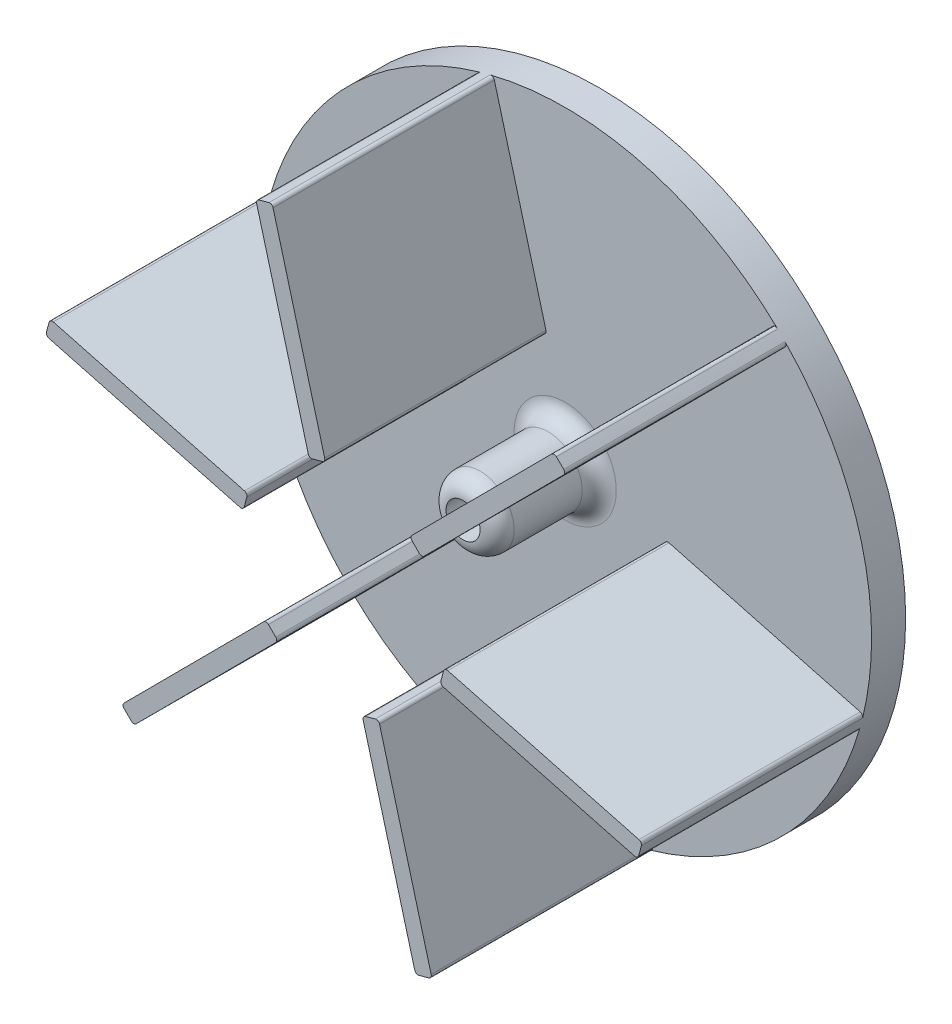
ISO-10303-21;
HEADER;
FILE_DESCRIPTION(('STEP AP214'),'2;1');
FILE_NAME('part.step','',(''),(''),'','','');
FILE_SCHEMA(('AUTOMOTIVE_DESIGN { 1 0 10303 214 1 1 1 1 }'));
ENDSEC;
DATA;
#1=APPLICATION_CONTEXT('core data for automotive mechanical design processes');
#2=APPLICATION_PROTOCOL_DEFINITION('international standard','automotive_design',2000,#1);
#3=PRODUCT_CONTEXT('',#1,'mechanical');
#4=PRODUCT('Part','Part','',(#3));
#5=PRODUCT_RELATED_PRODUCT_CATEGORY('part','',(#4));
#6=PRODUCT_DEFINITION_FORMATION('','',#4);
#7=PRODUCT_DEFINITION_CONTEXT('part definition',#1,'design');
#8=PRODUCT_DEFINITION('design','',#6,#7);
#9=PRODUCT_DEFINITION_SHAPE('','',#8);
#10=(LENGTH_UNIT() NAMED_UNIT(*) SI_UNIT(.MILLI.,.METRE.));
#11=(NAMED_UNIT(*) PLANE_ANGLE_UNIT() SI_UNIT($,.RADIAN.));
#12=(NAMED_UNIT(*) SI_UNIT($,.STERADIAN.) SOLID_ANGLE_UNIT());
#13=UNCERTAINTY_MEASURE_WITH_UNIT(LENGTH_MEASURE(1.E-05),#10,'distance_accuracy_value','');
#14=(GEOMETRIC_REPRESENTATION_CONTEXT(3) GLOBAL_UNCERTAINTY_ASSIGNED_CONTEXT((#13)) GLOBAL_UNIT_ASSIGNED_CONTEXT((#10,
#11,#12)) REPRESENTATION_CONTEXT('',''));
#15=CARTESIAN_POINT('',(0.,0.,0.));
#16=DIRECTION('',(0.,0.,1.));
#17=DIRECTION('',(1.,0.,0.));
#18=AXIS2_PLACEMENT_3D('',#15,#16,#17);
#19=CARTESIAN_POINT('',(0.,0.,0.));
#20=DIRECTION('',(0.,0.,1.));
#21=DIRECTION('',(1.,0.,0.));
#22=AXIS2_PLACEMENT_3D('',#19,#20,#21);
#23=PLANE('',#22);
#24=CARTESIAN_POINT('',(0.,0.,0.));
#25=DIRECTION('',(0.,0.,1.));
#26=DIRECTION('',(1.,0.,0.));
#27=AXIS2_PLACEMENT_3D('',#24,#25,#26);
#28=CIRCLE('',#27,3.);
#29=CARTESIAN_POINT('',(3.,0.,0.));
#30=VERTEX_POINT('',#29);
#31=EDGE_CURVE('E399',#30,#30,#28,.F.);
#32=ORIENTED_EDGE('',*,*,#31,.T.);
#33=EDGE_LOOP('',(#32));
#34=FACE_BOUND('',#33,.T.);
#35=CARTESIAN_POINT('',(0.,0.,0.));
#36=DIRECTION('',(0.,0.,1.));
#37=DIRECTION('',(1.,0.,0.));
#38=AXIS2_PLACEMENT_3D('',#35,#36,#37);
#39=CIRCLE('',#38,18.);
#40=CARTESIAN_POINT('',(12.4831508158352,12.9680740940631,0.));
#41=VERTEX_POINT('',#40);
#42=CARTESIAN_POINT('',(-4.40338510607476,17.4530856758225,0.));
#43=VERTEX_POINT('',#42);
#44=EDGE_CURVE('E55',#41,#43,#39,.T.);
#45=ORIENTED_EDGE('',*,*,#44,.T.);
#46=CARTESIAN_POINT('',(-4.35445860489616,17.2591625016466,0.));
#47=DIRECTION('',(0.,0.,1.));
#48=DIRECTION('',(1.,0.,0.));
#49=AXIS2_PLACEMENT_3D('',#46,#47,#48);
#50=CIRCLE('',#49,0.2);
#51=CARTESIAN_POINT('',(-4.16138757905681,17.3113504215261,0.));
#52=VERTEX_POINT('',#51);
#53=EDGE_CURVE('E48',#43,#52,#50,.F.);
#54=ORIENTED_EDGE('',*,*,#53,.T.);
#55=DIRECTION('',(-0.260939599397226,0.96535512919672,0.));
#56=VECTOR('',#55,1.);
#57=CARTESIAN_POINT('',(-1.07751431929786,5.90245397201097,0.));
#58=LINE('',#57,#56);
#59=CARTESIAN_POINT('',(-1.12970223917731,6.09552499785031,0.));
#60=VERTEX_POINT('',#59);
#61=EDGE_CURVE('E608',#60,#52,#58,.T.);
#62=ORIENTED_EDGE('',*,*,#61,.F.);
#63=CARTESIAN_POINT('',(-1.32277326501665,6.04333707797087,0.));
#64=DIRECTION('',(0.,0.,1.));
#65=DIRECTION('',(1.,0.,0.));
#66=AXIS2_PLACEMENT_3D('',#63,#64,#65);
#67=CIRCLE('',#66,0.2);
#68=CARTESIAN_POINT('',(-1.27058534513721,5.85026605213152,0.));
#69=VERTEX_POINT('',#68);
#70=EDGE_CURVE('E605',#60,#69,#67,.F.);
#71=ORIENTED_EDGE('',*,*,#70,.T.);
#72=DIRECTION('',(0.96535512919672,0.260939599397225,0.));
#73=VECTOR('',#72,1.);
#74=CARTESIAN_POINT('',(-2.04286944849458,5.64151437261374,0.));
#75=LINE('',#74,#73);
#76=CARTESIAN_POINT('',(-1.84979842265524,5.69370229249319,0.));
#77=VERTEX_POINT('',#76);
#78=EDGE_CURVE('E618',#77,#69,#75,.T.);
#79=ORIENTED_EDGE('',*,*,#78,.F.);
#80=CARTESIAN_POINT('',(-1.90198634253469,5.88677331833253,0.));
#81=DIRECTION('',(0.,0.,1.));
#82=DIRECTION('',(1.,0.,0.));
#83=AXIS2_PLACEMENT_3D('',#80,#81,#82);
#84=CIRCLE('',#83,0.2);
#85=CARTESIAN_POINT('',(-2.09505736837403,5.83458539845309,0.));
#86=VERTEX_POINT('',#85);
#87=EDGE_CURVE('E603',#77,#86,#84,.F.);
#88=ORIENTED_EDGE('',*,*,#87,.T.);
#89=DIRECTION('',(0.260939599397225,-0.96535512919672,0.));
#90=VECTOR('',#89,1.);
#91=CARTESIAN_POINT('',(-2.04286944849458,5.64151437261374,0.));
#92=LINE('',#91,#90);
#93=CARTESIAN_POINT('',(-5.12674270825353,17.0504108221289,0.));
#94=VERTEX_POINT('',#93);
#95=EDGE_CURVE('E617',#94,#86,#92,.T.);
#96=ORIENTED_EDGE('',*,*,#95,.F.);
#97=CARTESIAN_POINT('',(-4.93367168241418,17.1025987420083,0.));
#98=DIRECTION('',(0.,0.,1.));
#99=DIRECTION('',(1.,0.,0.));
#100=AXIS2_PLACEMENT_3D('',#97,#98,#99);
#101=CIRCLE('',#100,0.2);
#102=CARTESIAN_POINT('',(-4.98910619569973,17.2947627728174,0.));
#103=VERTEX_POINT('',#102);
#104=EDGE_CURVE('E11',#94,#103,#101,.F.);
#105=ORIENTED_EDGE('',*,*,#104,.T.);
#106=CARTESIAN_POINT('',(-17.3165081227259,4.9130994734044,0.));
#107=VERTEX_POINT('',#106);
#108=EDGE_CURVE('E63',#103,#107,#39,.T.);
#109=ORIENTED_EDGE('',*,*,#108,.T.);
#110=CARTESIAN_POINT('',(-17.1241024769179,4.85850947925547,0.));
#111=DIRECTION('',(0.,0.,1.));
#112=DIRECTION('',(1.,0.,0.));
#113=AXIS2_PLACEMENT_3D('',#110,#111,#112);
#114=CIRCLE('',#113,0.2);
#115=CARTESIAN_POINT('',(-17.0727630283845,5.05180785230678,0.));
#116=VERTEX_POINT('',#115);
#117=EDGE_CURVE('E570',#107,#116,#114,.F.);
#118=ORIENTED_EDGE('',*,*,#117,.T.);
#119=DIRECTION('',(-0.966491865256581,0.256697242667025,0.));
#120=VECTOR('',#119,1.);
#121=CARTESIAN_POINT('',(-5.6504322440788,2.01807221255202,0.));
#122=LINE('',#121,#120);
#123=CARTESIAN_POINT('',(-5.84373061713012,2.06941166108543,0.));
#124=VERTEX_POINT('',#123);
#125=EDGE_CURVE('E660',#124,#116,#122,.T.);
#126=ORIENTED_EDGE('',*,*,#125,.F.);
#127=CARTESIAN_POINT('',(-5.89507006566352,1.87611328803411,0.));
#128=DIRECTION('',(0.,0.,1.));
#129=DIRECTION('',(1.,0.,0.));
#130=AXIS2_PLACEMENT_3D('',#127,#128,#129);
#131=CIRCLE('',#130,0.2);
#132=CARTESIAN_POINT('',(-5.7017716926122,1.82477383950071,0.));
#133=VERTEX_POINT('',#132);
#134=EDGE_CURVE('E568',#124,#133,#131,.F.);
#135=ORIENTED_EDGE('',*,*,#134,.T.);
#136=DIRECTION('',(0.256697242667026,0.966491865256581,0.));
#137=VECTOR('',#136,1.);
#138=CARTESIAN_POINT('',(-5.90712948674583,1.05158034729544,0.));
#139=LINE('',#138,#137);
#140=CARTESIAN_POINT('',(-5.85579003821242,1.24487872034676,0.));
#141=VERTEX_POINT('',#140);
#142=EDGE_CURVE('E634',#141,#133,#139,.T.);
#143=ORIENTED_EDGE('',*,*,#142,.F.);
#144=CARTESIAN_POINT('',(-6.04908841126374,1.29621816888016,0.));
#145=DIRECTION('',(0.,0.,1.));
#146=DIRECTION('',(1.,0.,0.));
#147=AXIS2_PLACEMENT_3D('',#144,#145,#146);
#148=CIRCLE('',#147,0.2);
#149=CARTESIAN_POINT('',(-6.10042785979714,1.10291979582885,0.));
#150=VERTEX_POINT('',#149);
#151=EDGE_CURVE('E566',#141,#150,#148,.F.);
#152=ORIENTED_EDGE('',*,*,#151,.T.);
#153=DIRECTION('',(0.966491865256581,-0.256697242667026,0.));
#154=VECTOR('',#153,1.);
#155=CARTESIAN_POINT('',(-5.90712948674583,1.05158034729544,0.));
#156=LINE('',#155,#154);
#157=CARTESIAN_POINT('',(-17.3294602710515,4.08531598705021,0.));
#158=VERTEX_POINT('',#157);
#159=EDGE_CURVE('E648',#158,#150,#156,.T.);
#160=ORIENTED_EDGE('',*,*,#159,.F.);
#161=CARTESIAN_POINT('',(-17.2781208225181,4.27861436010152,0.));
#162=DIRECTION('',(0.,0.,1.));
#163=DIRECTION('',(1.,0.,0.));
#164=AXIS2_PLACEMENT_3D('',#161,#162,#163);
#165=CIRCLE('',#164,0.2);
#166=CARTESIAN_POINT('',(-17.4722570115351,4.32668867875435,0.));
#167=VERTEX_POINT('',#166);
#168=EDGE_CURVE('E572',#158,#167,#165,.F.);
#169=ORIENTED_EDGE('',*,*,#168,.T.);
#170=CARTESIAN_POINT('',(-12.913123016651,-12.5399862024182,0.));
#171=VERTEX_POINT('',#170);
#172=EDGE_CURVE('E977',#167,#171,#39,.T.);
#173=ORIENTED_EDGE('',*,*,#172,.T.);
#174=CARTESIAN_POINT('',(-12.7696438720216,-12.4006530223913,0.));
#175=DIRECTION('',(0.,0.,1.));
#176=DIRECTION('',(1.,0.,0.));
#177=AXIS2_PLACEMENT_3D('',#174,#175,#176);
#178=CIRCLE('',#177,0.2);
#179=CARTESIAN_POINT('',(-12.9113754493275,-12.2595425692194,0.));
#180=VERTEX_POINT('',#179);
#181=EDGE_CURVE('E534',#171,#180,#178,.F.);
#182=ORIENTED_EDGE('',*,*,#181,.T.);
#183=DIRECTION('',(-0.705552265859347,-0.7086578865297,0.));
#184=VECTOR('',#183,1.);
#185=CARTESIAN_POINT('',(-4.57291792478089,-3.88438175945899,0.));
#186=LINE('',#185,#184);
#187=CARTESIAN_POINT('',(-4.71402837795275,-4.02611333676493,0.));
#188=VERTEX_POINT('',#187);
#189=EDGE_CURVE('E681',#188,#180,#186,.T.);
#190=ORIENTED_EDGE('',*,*,#189,.F.);
#191=CARTESIAN_POINT('',(-4.57229680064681,-4.16722378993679,0.));
#192=DIRECTION('',(0.,0.,1.));
#193=DIRECTION('',(1.,0.,0.));
#194=AXIS2_PLACEMENT_3D('',#191,#192,#193);
#195=CIRCLE('',#194,0.2);
#196=CARTESIAN_POINT('',(-4.43118634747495,-4.02549221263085,0.));
#197=VERTEX_POINT('',#196);
#198=EDGE_CURVE('E532',#188,#197,#195,.F.);
#199=ORIENTED_EDGE('',*,*,#198,.T.);
#200=DIRECTION('',(-0.7086578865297,0.705552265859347,0.));
#201=VECTOR('',#200,1.);
#202=CARTESIAN_POINT('',(-3.86426003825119,-4.58993402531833,0.));
#203=LINE('',#202,#201);
#204=CARTESIAN_POINT('',(-4.00599161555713,-4.44882357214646,0.));
#205=VERTEX_POINT('',#204);
#206=EDGE_CURVE('E657',#205,#197,#203,.T.);
#207=ORIENTED_EDGE('',*,*,#206,.F.);
#208=CARTESIAN_POINT('',(-4.147102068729,-4.5905551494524,0.));
#209=DIRECTION('',(0.,0.,1.));
#210=DIRECTION('',(1.,0.,0.));
#211=AXIS2_PLACEMENT_3D('',#208,#209,#210);
#212=CIRCLE('',#211,0.2);
#213=CARTESIAN_POINT('',(-4.00537049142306,-4.73166560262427,0.));
#214=VERTEX_POINT('',#213);
#215=EDGE_CURVE('E530',#205,#214,#212,.F.);
#216=ORIENTED_EDGE('',*,*,#215,.T.);
#217=DIRECTION('',(0.705552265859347,0.7086578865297,0.));
#218=VECTOR('',#217,1.);
#219=CARTESIAN_POINT('',(-3.86426003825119,-4.58993402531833,0.));
#220=LINE('',#219,#218);
#221=CARTESIAN_POINT('',(-12.2027175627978,-12.9650948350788,0.));
#222=VERTEX_POINT('',#221);
#223=EDGE_CURVE('E669',#222,#214,#220,.T.);
#224=ORIENTED_EDGE('',*,*,#223,.F.);
#225=CARTESIAN_POINT('',(-12.3444491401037,-12.8239843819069,0.));
#226=DIRECTION('',(0.,0.,1.));
#227=DIRECTION('',(1.,0.,0.));
#228=AXIS2_PLACEMENT_3D('',#225,#226,#227);
#229=CIRCLE('',#228,0.2);
#230=CARTESIAN_POINT('',(-12.4831508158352,-12.9680740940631,0.));
#231=VERTEX_POINT('',#230);
#232=EDGE_CURVE('E536',#222,#231,#229,.F.);
#233=ORIENTED_EDGE('',*,*,#232,.T.);
#234=CARTESIAN_POINT('',(4.40338510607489,-17.4530856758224,0.));
#235=VERTEX_POINT('',#234);
#236=EDGE_CURVE('E998',#231,#235,#39,.T.);
#237=ORIENTED_EDGE('',*,*,#236,.T.);
#238=CARTESIAN_POINT('',(4.35445860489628,-17.2591625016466,0.));
#239=DIRECTION('',(0.,0.,1.));
#240=DIRECTION('',(1.,0.,0.));
#241=AXIS2_PLACEMENT_3D('',#238,#239,#240);
#242=CIRCLE('',#241,0.2);
#243=CARTESIAN_POINT('',(4.16138757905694,-17.3113504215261,0.));
#244=VERTEX_POINT('',#243);
#245=EDGE_CURVE('E497',#235,#244,#242,.F.);
#246=ORIENTED_EDGE('',*,*,#245,.T.);
#247=DIRECTION('',(0.260939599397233,-0.965355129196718,0.));
#248=VECTOR('',#247,1.);
#249=CARTESIAN_POINT('',(1.07751431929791,-5.90245397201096,0.));
#250=LINE('',#249,#248);
#251=CARTESIAN_POINT('',(1.12970223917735,-6.0955249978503,0.));
#252=VERTEX_POINT('',#251);
#253=EDGE_CURVE('E702',#252,#244,#250,.T.);
#254=ORIENTED_EDGE('',*,*,#253,.F.);
#255=CARTESIAN_POINT('',(1.3227732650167,-6.04333707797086,0.));
#256=DIRECTION('',(0.,0.,1.));
#257=DIRECTION('',(1.,0.,0.));
#258=AXIS2_PLACEMENT_3D('',#255,#256,#257);
#259=CIRCLE('',#258,0.2);
#260=CARTESIAN_POINT('',(1.27058534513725,-5.85026605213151,0.));
#261=VERTEX_POINT('',#260);
#262=EDGE_CURVE('E495',#252,#261,#259,.F.);
#263=ORIENTED_EDGE('',*,*,#262,.T.);
#264=DIRECTION('',(-0.965355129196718,-0.260939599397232,0.));
#265=VECTOR('',#264,1.);
#266=CARTESIAN_POINT('',(2.04286944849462,-5.64151437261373,0.));
#267=LINE('',#266,#265);
#268=CARTESIAN_POINT('',(1.84979842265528,-5.69370229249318,0.));
#269=VERTEX_POINT('',#268);
#270=EDGE_CURVE('E678',#269,#261,#267,.T.);
#271=ORIENTED_EDGE('',*,*,#270,.F.);
#272=CARTESIAN_POINT('',(1.90198634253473,-5.88677331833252,0.));
#273=DIRECTION('',(0.,0.,1.));
#274=DIRECTION('',(1.,0.,0.));
#275=AXIS2_PLACEMENT_3D('',#272,#273,#274);
#276=CIRCLE('',#275,0.2);
#277=CARTESIAN_POINT('',(2.09505736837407,-5.83458539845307,0.));
#278=VERTEX_POINT('',#277);
#279=EDGE_CURVE('E493',#269,#278,#276,.F.);
#280=ORIENTED_EDGE('',*,*,#279,.T.);
#281=DIRECTION('',(-0.260939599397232,0.965355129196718,0.));
#282=VECTOR('',#281,1.);
#283=CARTESIAN_POINT('',(2.04286944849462,-5.64151437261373,0.));
#284=LINE('',#283,#282);
#285=CARTESIAN_POINT('',(5.12674270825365,-17.0504108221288,0.));
#286=VERTEX_POINT('',#285);
#287=EDGE_CURVE('E690',#286,#278,#284,.T.);
#288=ORIENTED_EDGE('',*,*,#287,.F.);
#289=CARTESIAN_POINT('',(4.9336716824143,-17.1025987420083,0.));
#290=DIRECTION('',(0.,0.,1.));
#291=DIRECTION('',(1.,0.,0.));
#292=AXIS2_PLACEMENT_3D('',#289,#290,#291);
#293=CIRCLE('',#292,0.2);
#294=CARTESIAN_POINT('',(4.98910619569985,-17.2947627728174,0.));
#295=VERTEX_POINT('',#294);
#296=EDGE_CURVE('E499',#286,#295,#293,.F.);
#297=ORIENTED_EDGE('',*,*,#296,.T.);
#298=CARTESIAN_POINT('',(17.316508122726,-4.91309947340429,0.));
#299=VERTEX_POINT('',#298);
#300=EDGE_CURVE('E1019',#295,#299,#39,.T.);
#301=ORIENTED_EDGE('',*,*,#300,.T.);
#302=CARTESIAN_POINT('',(17.1241024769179,-4.85850947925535,0.));
#303=DIRECTION('',(0.,0.,1.));
#304=DIRECTION('',(1.,0.,0.));
#305=AXIS2_PLACEMENT_3D('',#302,#303,#304);
#306=CIRCLE('',#305,0.2);
#307=CARTESIAN_POINT('',(17.0727630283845,-5.05180785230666,0.));
#308=VERTEX_POINT('',#307);
#309=EDGE_CURVE('E460',#299,#308,#306,.F.);
#310=ORIENTED_EDGE('',*,*,#309,.T.);
#311=DIRECTION('',(0.966491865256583,-0.256697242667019,0.));
#312=VECTOR('',#311,1.);
#313=CARTESIAN_POINT('',(5.65043224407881,-2.01807221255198,0.));
#314=LINE('',#313,#312);
#315=CARTESIAN_POINT('',(5.84373061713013,-2.06941166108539,0.));
#316=VERTEX_POINT('',#315);
#317=EDGE_CURVE('E718',#316,#308,#314,.T.);
#318=ORIENTED_EDGE('',*,*,#317,.F.);
#319=CARTESIAN_POINT('',(5.89507006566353,-1.87611328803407,0.));
#320=DIRECTION('',(0.,0.,1.));
#321=DIRECTION('',(1.,0.,0.));
#322=AXIS2_PLACEMENT_3D('',#319,#320,#321);
#323=CIRCLE('',#322,0.2);
#324=CARTESIAN_POINT('',(5.70177169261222,-1.82477383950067,0.));
#325=VERTEX_POINT('',#324);
#326=EDGE_CURVE('E458',#316,#325,#323,.F.);
#327=ORIENTED_EDGE('',*,*,#326,.T.);
#328=DIRECTION('',(-0.256697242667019,-0.966491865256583,0.));
#329=VECTOR('',#328,1.);
#330=CARTESIAN_POINT('',(5.90712948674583,-1.0515803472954,0.));
#331=LINE('',#330,#329);
#332=CARTESIAN_POINT('',(5.85579003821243,-1.24487872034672,0.));
#333=VERTEX_POINT('',#332);
#334=EDGE_CURVE('E699',#333,#325,#331,.T.);
#335=ORIENTED_EDGE('',*,*,#334,.F.);
#336=CARTESIAN_POINT('',(6.04908841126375,-1.29621816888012,0.));
#337=DIRECTION('',(0.,0.,1.));
#338=DIRECTION('',(1.,0.,0.));
#339=AXIS2_PLACEMENT_3D('',#336,#337,#338);
#340=CIRCLE('',#339,0.2);
#341=CARTESIAN_POINT('',(6.10042785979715,-1.1029197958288,0.));
#342=VERTEX_POINT('',#341);
#343=EDGE_CURVE('E456',#333,#342,#340,.F.);
#344=ORIENTED_EDGE('',*,*,#343,.T.);
#345=DIRECTION('',(-0.966491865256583,0.256697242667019,0.));
#346=VECTOR('',#345,1.);
#347=CARTESIAN_POINT('',(5.90712948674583,-1.0515803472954,0.));
#348=LINE('',#347,#346);
#349=CARTESIAN_POINT('',(17.3294602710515,-4.08531598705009,0.));
#350=VERTEX_POINT('',#349);
#351=EDGE_CURVE('E711',#350,#342,#348,.T.);
#352=ORIENTED_EDGE('',*,*,#351,.F.);
#353=CARTESIAN_POINT('',(17.2781208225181,-4.2786143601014,0.));
#354=DIRECTION('',(0.,0.,1.));
#355=DIRECTION('',(1.,0.,0.));
#356=AXIS2_PLACEMENT_3D('',#353,#354,#355);
#357=CIRCLE('',#356,0.2);
#358=CARTESIAN_POINT('',(17.4722570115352,-4.32668867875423,0.));
#359=VERTEX_POINT('',#358);
#360=EDGE_CURVE('E462',#350,#359,#357,.F.);
#361=ORIENTED_EDGE('',*,*,#360,.T.);
#362=CARTESIAN_POINT('',(12.913123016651,12.5399862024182,0.));
#363=VERTEX_POINT('',#362);
#364=EDGE_CURVE('E388',#359,#363,#39,.T.);
#365=ORIENTED_EDGE('',*,*,#364,.T.);
#366=CARTESIAN_POINT('',(12.7696438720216,12.4006530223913,0.));
#367=DIRECTION('',(0.,0.,1.));
#368=DIRECTION('',(1.,0.,0.));
#369=AXIS2_PLACEMENT_3D('',#366,#367,#368);
#370=CIRCLE('',#369,0.2);
#371=CARTESIAN_POINT('',(12.9113754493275,12.2595425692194,0.));
#372=VERTEX_POINT('',#371);
#373=EDGE_CURVE('E424',#363,#372,#370,.F.);
#374=ORIENTED_EDGE('',*,*,#373,.T.);
#375=DIRECTION('',(0.705552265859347,0.7086578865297,0.));
#376=VECTOR('',#375,1.);
#377=CARTESIAN_POINT('',(4.57291792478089,3.88438175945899,0.));
#378=LINE('',#377,#376);
#379=CARTESIAN_POINT('',(4.71402837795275,4.02611333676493,0.));
#380=VERTEX_POINT('',#379);
#381=EDGE_CURVE('E368',#380,#372,#378,.T.);
#382=ORIENTED_EDGE('',*,*,#381,.F.);
#383=CARTESIAN_POINT('',(4.57229680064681,4.16722378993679,0.));
#384=DIRECTION('',(0.,0.,1.));
#385=DIRECTION('',(1.,0.,0.));
#386=AXIS2_PLACEMENT_3D('',#383,#384,#385);
#387=CIRCLE('',#386,0.2);
#388=CARTESIAN_POINT('',(4.43118634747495,4.02549221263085,0.));
#389=VERTEX_POINT('',#388);
#390=EDGE_CURVE('E353',#380,#389,#387,.F.);
#391=ORIENTED_EDGE('',*,*,#390,.T.);
#392=DIRECTION('',(0.7086578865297,-0.705552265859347,0.));
#393=VECTOR('',#392,1.);
#394=CARTESIAN_POINT('',(3.86426003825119,4.58993402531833,0.));
#395=LINE('',#394,#393);
#396=CARTESIAN_POINT('',(4.00599161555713,4.44882357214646,0.));
#397=VERTEX_POINT('',#396);
#398=EDGE_CURVE('E360',#397,#389,#395,.T.);
#399=ORIENTED_EDGE('',*,*,#398,.F.);
#400=CARTESIAN_POINT('',(4.147102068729,4.5905551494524,0.));
#401=DIRECTION('',(0.,0.,1.));
#402=DIRECTION('',(1.,0.,0.));
#403=AXIS2_PLACEMENT_3D('',#400,#401,#402);
#404=CIRCLE('',#403,0.2);
#405=CARTESIAN_POINT('',(4.00537049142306,4.73166560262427,0.));
#406=VERTEX_POINT('',#405);
#407=EDGE_CURVE('E344',#397,#406,#404,.F.);
#408=ORIENTED_EDGE('',*,*,#407,.T.);
#409=DIRECTION('',(-0.705552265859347,-0.7086578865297,0.));
#410=VECTOR('',#409,1.);
#411=CARTESIAN_POINT('',(3.86426003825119,4.58993402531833,0.));
#412=LINE('',#411,#410);
#413=CARTESIAN_POINT('',(12.2027175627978,12.9650948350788,0.));
#414=VERTEX_POINT('',#413);
#415=EDGE_CURVE('E372',#414,#406,#412,.T.);
#416=ORIENTED_EDGE('',*,*,#415,.F.);
#417=CARTESIAN_POINT('',(12.3444491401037,12.8239843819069,0.));
#418=DIRECTION('',(0.,0.,1.));
#419=DIRECTION('',(1.,0.,0.));
#420=AXIS2_PLACEMENT_3D('',#417,#418,#419);
#421=CIRCLE('',#420,0.2);
#422=EDGE_CURVE('E426',#414,#41,#421,.F.);
#423=ORIENTED_EDGE('',*,*,#422,.T.);
#424=EDGE_LOOP('',(#45,#54,#62,#71,#79,#88,#96,#105,#109,#118,#126,#135,#143,#152,#160,#169,
#173,#182,#190,#199,#207,#216,#224,#233,#237,#246,#254,#263,#271,#280,#288,#297,#301,#310,#318,
#327,#335,#344,#352,#361,#365,#374,#382,#391,#399,#408,#416,#423));
#425=FACE_BOUND('',#424,.T.);
#426=ADVANCED_FACE('F40',(#34,#425),#23,.T.);
#427=CARTESIAN_POINT('',(0.,0.,-2.));
#428=DIRECTION('',(0.,0.,1.));
#429=DIRECTION('',(1.,0.,0.));
#430=AXIS2_PLACEMENT_3D('',#427,#428,#429);
#431=CYLINDRICAL_SURFACE('',#430,18.);
#432=CARTESIAN_POINT('',(0.,0.,-2.));
#433=DIRECTION('',(0.,0.,1.));
#434=DIRECTION('',(1.,0.,0.));
#435=AXIS2_PLACEMENT_3D('',#432,#433,#434);
#436=CIRCLE('',#435,18.);
#437=CARTESIAN_POINT('',(18.,0.,-2.));
#438=VERTEX_POINT('',#437);
#439=EDGE_CURVE('E389',#438,#438,#436,.T.);
#440=ORIENTED_EDGE('',*,*,#439,.T.);
#441=EDGE_LOOP('',(#440));
#442=FACE_BOUND('',#441,.T.);
#443=CARTESIAN_POINT('',(0.,0.,13.));
#444=DIRECTION('',(0.,0.,1.));
#445=DIRECTION('',(0.50000000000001,0.866025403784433,0.));
#446=AXIS2_PLACEMENT_3D('',#443,#444,#445);
#447=CIRCLE('',#446,18.);
#448=CARTESIAN_POINT('',(-4.40338510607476,17.4530856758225,13.));
#449=VERTEX_POINT('',#448);
#450=CARTESIAN_POINT('',(-4.98910619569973,17.2947627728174,13.));
#451=VERTEX_POINT('',#450);
#452=EDGE_CURVE('E627',#449,#451,#447,.T.);
#453=ORIENTED_EDGE('',*,*,#452,.F.);
#454=DIRECTION('',(0.,0.,1.));
#455=VECTOR('',#454,1.);
#456=CARTESIAN_POINT('',(-4.40338510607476,17.4530856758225,-2.));
#457=LINE('',#456,#455);
#458=EDGE_CURVE('E600',#449,#43,#457,.F.);
#459=ORIENTED_EDGE('',*,*,#458,.T.);
#460=ORIENTED_EDGE('',*,*,#44,.F.);
#461=DIRECTION('',(0.,0.,1.));
#462=VECTOR('',#461,1.);
#463=CARTESIAN_POINT('',(12.4831508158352,12.9680740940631,-2.));
#464=LINE('',#463,#462);
#465=CARTESIAN_POINT('',(12.4831508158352,12.9680740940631,13.));
#466=VERTEX_POINT('',#465);
#467=EDGE_CURVE('E419',#41,#466,#464,.T.);
#468=ORIENTED_EDGE('',*,*,#467,.T.);
#469=CARTESIAN_POINT('',(0.,0.,13.));
#470=DIRECTION('',(0.,0.,1.));
#471=DIRECTION('',(1.,0.,0.));
#472=AXIS2_PLACEMENT_3D('',#469,#470,#471);
#473=CIRCLE('',#472,18.);
#474=CARTESIAN_POINT('',(12.913123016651,12.5399862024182,13.));
#475=VERTEX_POINT('',#474);
#476=EDGE_CURVE('E726',#475,#466,#473,.T.);
#477=ORIENTED_EDGE('',*,*,#476,.F.);
#478=DIRECTION('',(0.,0.,1.));
#479=VECTOR('',#478,1.);
#480=CARTESIAN_POINT('',(12.913123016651,12.5399862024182,-2.));
#481=LINE('',#480,#479);
#482=EDGE_CURVE('E354',#475,#363,#481,.F.);
#483=ORIENTED_EDGE('',*,*,#482,.T.);
#484=ORIENTED_EDGE('',*,*,#364,.F.);
#485=DIRECTION('',(0.,0.,1.));
#486=VECTOR('',#485,1.);
#487=CARTESIAN_POINT('',(17.4722570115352,-4.32668867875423,-2.));
#488=LINE('',#487,#486);
#489=CARTESIAN_POINT('',(17.4722570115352,-4.32668867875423,13.));
#490=VERTEX_POINT('',#489);
#491=EDGE_CURVE('E451',#359,#490,#488,.T.);
#492=ORIENTED_EDGE('',*,*,#491,.T.);
#493=CARTESIAN_POINT('',(0.,0.,13.));
#494=DIRECTION('',(0.,0.,1.));
#495=DIRECTION('',(0.499999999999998,-0.86602540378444,0.));
#496=AXIS2_PLACEMENT_3D('',#493,#494,#495);
#497=CIRCLE('',#496,18.);
#498=CARTESIAN_POINT('',(17.316508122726,-4.91309947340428,13.));
#499=VERTEX_POINT('',#498);
#500=EDGE_CURVE('E375',#499,#490,#497,.T.);
#501=ORIENTED_EDGE('',*,*,#500,.F.);
#502=DIRECTION('',(0.,0.,1.));
#503=VECTOR('',#502,1.);
#504=CARTESIAN_POINT('',(17.316508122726,-4.91309947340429,-2.));
#505=LINE('',#504,#503);
#506=EDGE_CURVE('E453',#499,#299,#505,.F.);
#507=ORIENTED_EDGE('',*,*,#506,.T.);
#508=ORIENTED_EDGE('',*,*,#300,.F.);
#509=DIRECTION('',(0.,0.,1.));
#510=VECTOR('',#509,1.);
#511=CARTESIAN_POINT('',(4.98910619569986,-17.2947627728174,-2.));
#512=LINE('',#511,#510);
#513=CARTESIAN_POINT('',(4.98910619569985,-17.2947627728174,13.));
#514=VERTEX_POINT('',#513);
#515=EDGE_CURVE('E488',#295,#514,#512,.T.);
#516=ORIENTED_EDGE('',*,*,#515,.T.);
#517=CARTESIAN_POINT('',(0.,0.,13.));
#518=DIRECTION('',(0.,0.,1.));
#519=DIRECTION('',(-0.500000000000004,-0.866025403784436,0.));
#520=AXIS2_PLACEMENT_3D('',#517,#518,#519);
#521=CIRCLE('',#520,18.);
#522=CARTESIAN_POINT('',(4.40338510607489,-17.4530856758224,13.));
#523=VERTEX_POINT('',#522);
#524=EDGE_CURVE('E693',#523,#514,#521,.T.);
#525=ORIENTED_EDGE('',*,*,#524,.F.);
#526=DIRECTION('',(0.,0.,1.));
#527=VECTOR('',#526,1.);
#528=CARTESIAN_POINT('',(4.40338510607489,-17.4530856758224,-2.));
#529=LINE('',#528,#527);
#530=EDGE_CURVE('E490',#523,#235,#529,.F.);
#531=ORIENTED_EDGE('',*,*,#530,.T.);
#532=ORIENTED_EDGE('',*,*,#236,.F.);
#533=DIRECTION('',(0.,0.,1.));
#534=VECTOR('',#533,1.);
#535=CARTESIAN_POINT('',(-12.4831508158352,-12.9680740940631,-2.));
#536=LINE('',#535,#534);
#537=CARTESIAN_POINT('',(-12.4831508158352,-12.9680740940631,13.));
#538=VERTEX_POINT('',#537);
#539=EDGE_CURVE('E525',#231,#538,#536,.T.);
#540=ORIENTED_EDGE('',*,*,#539,.T.);
#541=CARTESIAN_POINT('',(0.,0.,13.));
#542=DIRECTION('',(0.,0.,1.));
#543=DIRECTION('',(-1.,0.,0.));
#544=AXIS2_PLACEMENT_3D('',#541,#542,#543);
#545=CIRCLE('',#544,18.);
#546=CARTESIAN_POINT('',(-12.913123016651,-12.5399862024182,13.));
#547=VERTEX_POINT('',#546);
#548=EDGE_CURVE('E672',#547,#538,#545,.T.);
#549=ORIENTED_EDGE('',*,*,#548,.F.);
#550=DIRECTION('',(0.,0.,1.));
#551=VECTOR('',#550,1.);
#552=CARTESIAN_POINT('',(-12.913123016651,-12.5399862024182,-2.));
#553=LINE('',#552,#551);
#554=EDGE_CURVE('E527',#547,#171,#553,.F.);
#555=ORIENTED_EDGE('',*,*,#554,.T.);
#556=ORIENTED_EDGE('',*,*,#172,.F.);
#557=DIRECTION('',(0.,0.,1.));
#558=VECTOR('',#557,1.);
#559=CARTESIAN_POINT('',(-17.4722570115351,4.32668867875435,-2.));
#560=LINE('',#559,#558);
#561=CARTESIAN_POINT('',(-17.4722570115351,4.32668867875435,13.));
#562=VERTEX_POINT('',#561);
#563=EDGE_CURVE('E562',#167,#562,#560,.T.);
#564=ORIENTED_EDGE('',*,*,#563,.T.);
#565=CARTESIAN_POINT('',(0.,0.,13.));
#566=DIRECTION('',(0.,0.,1.));
#567=DIRECTION('',(-0.499999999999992,0.866025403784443,0.));
#568=AXIS2_PLACEMENT_3D('',#565,#566,#567);
#569=CIRCLE('',#568,18.);
#570=CARTESIAN_POINT('',(-17.3165081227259,4.9130994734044,13.));
#571=VERTEX_POINT('',#570);
#572=EDGE_CURVE('E651',#571,#562,#569,.T.);
#573=ORIENTED_EDGE('',*,*,#572,.F.);
#574=DIRECTION('',(0.,0.,1.));
#575=VECTOR('',#574,1.);
#576=CARTESIAN_POINT('',(-17.3165081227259,4.9130994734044,-2.));
#577=LINE('',#576,#575);
#578=EDGE_CURVE('E564',#571,#107,#577,.F.);
#579=ORIENTED_EDGE('',*,*,#578,.T.);
#580=ORIENTED_EDGE('',*,*,#108,.F.);
#581=DIRECTION('',(0.,0.,1.));
#582=VECTOR('',#581,1.);
#583=CARTESIAN_POINT('',(-4.98910619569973,17.2947627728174,-2.));
#584=LINE('',#583,#582);
#585=EDGE_CURVE('E598',#103,#451,#584,.T.);
#586=ORIENTED_EDGE('',*,*,#585,.T.);
#587=EDGE_LOOP('',(#453,#459,#460,#468,#477,#483,#484,#492,#501,#507,#508,#516,#525,#531,#532,
#540,#549,#555,#556,#564,#573,#579,#580,#586));
#588=FACE_BOUND('',#587,.T.);
#589=ADVANCED_FACE('F630',(#442,#588),#431,.T.);
#590=CARTESIAN_POINT('',(0.,0.,-2.));
#591=DIRECTION('',(0.,0.,1.));
#592=DIRECTION('',(1.,0.,0.));
#593=AXIS2_PLACEMENT_3D('',#590,#591,#592);
#594=PLANE('',#593);
#595=CARTESIAN_POINT('',(0.,0.,-2.));
#596=DIRECTION('',(0.,0.,1.));
#597=DIRECTION('',(1.,0.,0.));
#598=AXIS2_PLACEMENT_3D('',#595,#596,#597);
#599=CIRCLE('',#598,1.);
#600=CARTESIAN_POINT('',(1.,0.,-2.));
#601=VERTEX_POINT('',#600);
#602=EDGE_CURVE('E385',#601,#601,#599,.T.);
#603=ORIENTED_EDGE('',*,*,#602,.T.);
#604=EDGE_LOOP('',(#603));
#605=FACE_BOUND('',#604,.T.);
#606=ORIENTED_EDGE('',*,*,#439,.F.);
#607=EDGE_LOOP('',(#606));
#608=FACE_BOUND('',#607,.T.);
#609=ADVANCED_FACE('F767',(#605,#608),#594,.F.);
#610=CARTESIAN_POINT('',(0.,0.,-2.));
#611=DIRECTION('',(0.,0.,1.));
#612=DIRECTION('',(1.,0.,0.));
#613=AXIS2_PLACEMENT_3D('',#610,#611,#612);
#614=CYLINDRICAL_SURFACE('',#613,1.);
#615=ORIENTED_EDGE('',*,*,#602,.F.);
#616=EDGE_LOOP('',(#615));
#617=FACE_BOUND('',#616,.T.);
#618=CARTESIAN_POINT('',(0.,0.,6.));
#619=DIRECTION('',(0.,0.,1.));
#620=DIRECTION('',(1.,0.,0.));
#621=AXIS2_PLACEMENT_3D('',#618,#619,#620);
#622=CIRCLE('',#621,1.);
#623=CARTESIAN_POINT('',(1.,0.,6.));
#624=VERTEX_POINT('',#623);
#625=EDGE_CURVE('E382',#624,#624,#622,.T.);
#626=ORIENTED_EDGE('',*,*,#625,.T.);
#627=EDGE_LOOP('',(#626));
#628=FACE_BOUND('',#627,.T.);
#629=ADVANCED_FACE('F790',(#617,#628),#614,.F.);
#630=CARTESIAN_POINT('',(0.,0.,6.));
#631=DIRECTION('',(0.,0.,-1.));
#632=DIRECTION('',(-1.,0.,0.));
#633=AXIS2_PLACEMENT_3D('',#630,#631,#632);
#634=CYLINDRICAL_SURFACE('',#633,2.);
#635=CARTESIAN_POINT('',(0.,0.,5.));
#636=DIRECTION('',(0.,0.,1.));
#637=DIRECTION('',(1.,0.,0.));
#638=AXIS2_PLACEMENT_3D('',#635,#636,#637);
#639=CIRCLE('',#638,2.);
#640=CARTESIAN_POINT('',(2.,0.,5.));
#641=VERTEX_POINT('',#640);
#642=EDGE_CURVE('E396',#641,#641,#639,.F.);
#643=ORIENTED_EDGE('',*,*,#642,.T.);
#644=EDGE_LOOP('',(#643));
#645=FACE_BOUND('',#644,.T.);
#646=CARTESIAN_POINT('',(0.,0.,1.));
#647=DIRECTION('',(0.,0.,1.));
#648=DIRECTION('',(1.,0.,0.));
#649=AXIS2_PLACEMENT_3D('',#646,#647,#648);
#650=CIRCLE('',#649,2.);
#651=CARTESIAN_POINT('',(2.,0.,1.));
#652=VERTEX_POINT('',#651);
#653=EDGE_CURVE('E392',#652,#652,#650,.T.);
#654=ORIENTED_EDGE('',*,*,#653,.T.);
#655=EDGE_LOOP('',(#654));
#656=FACE_BOUND('',#655,.T.);
#657=ADVANCED_FACE('F777',(#645,#656),#634,.T.);
#658=CARTESIAN_POINT('',(0.,0.,5.));
#659=DIRECTION('',(0.,0.,1.));
#660=DIRECTION('',(1.,0.,0.));
#661=AXIS2_PLACEMENT_3D('',#658,#659,#660);
#662=DEGENERATE_TOROIDAL_SURFACE('',#661,1.,1.,.T.);
#663=ORIENTED_EDGE('',*,*,#642,.F.);
#664=EDGE_LOOP('',(#663));
#665=FACE_BOUND('',#664,.T.);
#666=ORIENTED_EDGE('',*,*,#625,.F.);
#667=EDGE_LOOP('',(#666));
#668=FACE_BOUND('',#667,.T.);
#669=ADVANCED_FACE('F773',(#665,#668),#662,.T.);
#670=CARTESIAN_POINT('',(0.,0.,1.));
#671=DIRECTION('',(0.,0.,1.));
#672=DIRECTION('',(1.,0.,0.));
#673=AXIS2_PLACEMENT_3D('',#670,#671,#672);
#674=TOROIDAL_SURFACE('',#673,3.,1.);
#675=ORIENTED_EDGE('',*,*,#31,.F.);
#676=EDGE_LOOP('',(#675));
#677=FACE_BOUND('',#676,.T.);
#678=ORIENTED_EDGE('',*,*,#653,.F.);
#679=EDGE_LOOP('',(#678));
#680=FACE_BOUND('',#679,.T.);
#681=ADVANCED_FACE('F776',(#677,#680),#674,.F.);
#682=CARTESIAN_POINT('',(3.86426003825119,4.58993402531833,13.));
#683=DIRECTION('',(0.705552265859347,0.7086578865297,0.));
#684=DIRECTION('',(-0.7086578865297,0.705552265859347,0.));
#685=AXIS2_PLACEMENT_3D('',#682,#683,#684);
#686=PLANE('',#685);
#687=DIRECTION('',(0.7086578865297,-0.705552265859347,0.));
#688=VECTOR('',#687,1.);
#689=CARTESIAN_POINT('',(3.86426003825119,4.58993402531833,13.));
#690=LINE('',#689,#688);
#691=CARTESIAN_POINT('',(4.00599161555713,4.44882357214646,13.));
#692=VERTEX_POINT('',#691);
#693=CARTESIAN_POINT('',(4.43118634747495,4.02549221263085,13.));
#694=VERTEX_POINT('',#693);
#695=EDGE_CURVE('E363',#692,#694,#690,.T.);
#696=ORIENTED_EDGE('',*,*,#695,.F.);
#697=DIRECTION('',(0.,0.,-1.));
#698=VECTOR('',#697,1.);
#699=CARTESIAN_POINT('',(4.00599161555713,4.44882357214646,13.));
#700=LINE('',#699,#698);
#701=EDGE_CURVE('E348',#692,#397,#700,.T.);
#702=ORIENTED_EDGE('',*,*,#701,.T.);
#703=ORIENTED_EDGE('',*,*,#398,.T.);
#704=DIRECTION('',(0.,0.,-1.));
#705=VECTOR('',#704,1.);
#706=CARTESIAN_POINT('',(4.43118634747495,4.02549221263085,13.));
#707=LINE('',#706,#705);
#708=EDGE_CURVE('E365',#389,#694,#707,.F.);
#709=ORIENTED_EDGE('',*,*,#708,.T.);
#710=EDGE_LOOP('',(#696,#702,#703,#709));
#711=FACE_BOUND('',#710,.T.);
#712=ADVANCED_FACE('F359',(#711),#686,.F.);
#713=CARTESIAN_POINT('',(4.57291792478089,3.88438175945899,13.));
#714=DIRECTION('',(-0.7086578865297,0.705552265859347,0.));
#715=DIRECTION('',(-0.705552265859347,-0.7086578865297,0.));
#716=AXIS2_PLACEMENT_3D('',#713,#714,#715);
#717=PLANE('',#716);
#718=DIRECTION('',(0.705552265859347,0.7086578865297,0.));
#719=VECTOR('',#718,1.);
#720=CARTESIAN_POINT('',(4.57291792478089,3.88438175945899,13.));
#721=LINE('',#720,#719);
#722=CARTESIAN_POINT('',(4.71402837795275,4.02611333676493,13.));
#723=VERTEX_POINT('',#722);
#724=CARTESIAN_POINT('',(12.9113754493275,12.2595425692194,13.));
#725=VERTEX_POINT('',#724);
#726=EDGE_CURVE('E724',#723,#725,#721,.T.);
#727=ORIENTED_EDGE('',*,*,#726,.F.);
#728=DIRECTION('',(0.,0.,-1.));
#729=VECTOR('',#728,1.);
#730=CARTESIAN_POINT('',(4.71402837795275,4.02611333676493,13.));
#731=LINE('',#730,#729);
#732=EDGE_CURVE('E416',#723,#380,#731,.T.);
#733=ORIENTED_EDGE('',*,*,#732,.T.);
#734=ORIENTED_EDGE('',*,*,#381,.T.);
#735=DIRECTION('',(0.,0.,-1.));
#736=VECTOR('',#735,1.);
#737=CARTESIAN_POINT('',(12.9113754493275,12.2595425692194,13.));
#738=LINE('',#737,#736);
#739=EDGE_CURVE('E414',#372,#725,#738,.F.);
#740=ORIENTED_EDGE('',*,*,#739,.T.);
#741=EDGE_LOOP('',(#727,#733,#734,#740));
#742=FACE_BOUND('',#741,.T.);
#743=ADVANCED_FACE('F748',(#742),#717,.F.);
#744=CARTESIAN_POINT('',(3.86426003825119,4.58993402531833,13.));
#745=DIRECTION('',(0.7086578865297,-0.705552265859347,0.));
#746=DIRECTION('',(0.705552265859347,0.7086578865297,0.));
#747=AXIS2_PLACEMENT_3D('',#744,#745,#746);
#748=PLANE('',#747);
#749=ORIENTED_EDGE('',*,*,#415,.T.);
#750=DIRECTION('',(0.,0.,-1.));
#751=VECTOR('',#750,1.);
#752=CARTESIAN_POINT('',(4.00537049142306,4.73166560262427,13.));
#753=LINE('',#752,#751);
#754=CARTESIAN_POINT('',(4.00537049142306,4.73166560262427,13.));
#755=VERTEX_POINT('',#754);
#756=EDGE_CURVE('E349',#406,#755,#753,.F.);
#757=ORIENTED_EDGE('',*,*,#756,.T.);
#758=DIRECTION('',(-0.705552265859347,-0.7086578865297,0.));
#759=VECTOR('',#758,1.);
#760=CARTESIAN_POINT('',(3.86426003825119,4.58993402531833,13.));
#761=LINE('',#760,#759);
#762=CARTESIAN_POINT('',(12.2027175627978,12.9650948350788,13.));
#763=VERTEX_POINT('',#762);
#764=EDGE_CURVE('E378',#763,#755,#761,.T.);
#765=ORIENTED_EDGE('',*,*,#764,.F.);
#766=DIRECTION('',(0.,0.,-1.));
#767=VECTOR('',#766,1.);
#768=CARTESIAN_POINT('',(12.2027175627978,12.9650948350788,0.));
#769=LINE('',#768,#767);
#770=EDGE_CURVE('E364',#763,#414,#769,.T.);
#771=ORIENTED_EDGE('',*,*,#770,.T.);
#772=EDGE_LOOP('',(#749,#757,#765,#771));
#773=FACE_BOUND('',#772,.T.);
#774=ADVANCED_FACE('F736',(#773),#748,.F.);
#775=CARTESIAN_POINT('',(0.,0.,13.));
#776=DIRECTION('',(0.,0.,1.));
#777=DIRECTION('',(1.,0.,0.));
#778=AXIS2_PLACEMENT_3D('',#775,#776,#777);
#779=PLANE('',#778);
#780=ORIENTED_EDGE('',*,*,#764,.T.);
#781=CARTESIAN_POINT('',(4.147102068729,4.5905551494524,13.));
#782=DIRECTION('',(0.,0.,1.));
#783=DIRECTION('',(1.,0.,0.));
#784=AXIS2_PLACEMENT_3D('',#781,#782,#783);
#785=CIRCLE('',#784,0.2);
#786=EDGE_CURVE('E412',#755,#692,#785,.T.);
#787=ORIENTED_EDGE('',*,*,#786,.T.);
#788=ORIENTED_EDGE('',*,*,#695,.T.);
#789=CARTESIAN_POINT('',(4.57229680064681,4.16722378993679,13.));
#790=DIRECTION('',(0.,0.,1.));
#791=DIRECTION('',(1.,0.,0.));
#792=AXIS2_PLACEMENT_3D('',#789,#790,#791);
#793=CIRCLE('',#792,0.2);
#794=EDGE_CURVE('E410',#694,#723,#793,.T.);
#795=ORIENTED_EDGE('',*,*,#794,.T.);
#796=ORIENTED_EDGE('',*,*,#726,.T.);
#797=CARTESIAN_POINT('',(12.7696438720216,12.4006530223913,13.));
#798=DIRECTION('',(0.,0.,1.));
#799=DIRECTION('',(1.,0.,0.));
#800=AXIS2_PLACEMENT_3D('',#797,#798,#799);
#801=CIRCLE('',#800,0.2);
#802=EDGE_CURVE('E408',#725,#475,#801,.T.);
#803=ORIENTED_EDGE('',*,*,#802,.T.);
#804=ORIENTED_EDGE('',*,*,#476,.T.);
#805=CARTESIAN_POINT('',(12.3444491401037,12.8239843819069,13.));
#806=DIRECTION('',(0.,0.,1.));
#807=DIRECTION('',(1.,0.,0.));
#808=AXIS2_PLACEMENT_3D('',#805,#806,#807);
#809=CIRCLE('',#808,0.2);
#810=EDGE_CURVE('E406',#466,#763,#809,.T.);
#811=ORIENTED_EDGE('',*,*,#810,.T.);
#812=EDGE_LOOP('',(#780,#787,#788,#795,#796,#803,#804,#811));
#813=FACE_BOUND('',#812,.T.);
#814=ADVANCED_FACE('F733',(#813),#779,.T.);
#815=CARTESIAN_POINT('',(4.147102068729,4.5905551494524,13.));
#816=DIRECTION('',(0.,0.,-1.));
#817=DIRECTION('',(-1.,0.,0.));
#818=AXIS2_PLACEMENT_3D('',#815,#816,#817);
#819=CYLINDRICAL_SURFACE('',#818,0.2);
#820=ORIENTED_EDGE('',*,*,#786,.F.);
#821=ORIENTED_EDGE('',*,*,#756,.F.);
#822=ORIENTED_EDGE('',*,*,#407,.F.);
#823=ORIENTED_EDGE('',*,*,#701,.F.);
#824=EDGE_LOOP('',(#820,#821,#822,#823));
#825=FACE_BOUND('',#824,.T.);
#826=ADVANCED_FACE('F347',(#825),#819,.T.);
#827=CARTESIAN_POINT('',(4.57229680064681,4.16722378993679,13.));
#828=DIRECTION('',(0.,0.,-1.));
#829=DIRECTION('',(-1.,0.,0.));
#830=AXIS2_PLACEMENT_3D('',#827,#828,#829);
#831=CYLINDRICAL_SURFACE('',#830,0.2);
#832=ORIENTED_EDGE('',*,*,#794,.F.);
#833=ORIENTED_EDGE('',*,*,#708,.F.);
#834=ORIENTED_EDGE('',*,*,#390,.F.);
#835=ORIENTED_EDGE('',*,*,#732,.F.);
#836=EDGE_LOOP('',(#832,#833,#834,#835));
#837=FACE_BOUND('',#836,.T.);
#838=ADVANCED_FACE('F752',(#837),#831,.T.);
#839=CARTESIAN_POINT('',(12.7696438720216,12.4006530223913,-2.));
#840=DIRECTION('',(0.,0.,1.));
#841=DIRECTION('',(1.,0.,0.));
#842=AXIS2_PLACEMENT_3D('',#839,#840,#841);
#843=CYLINDRICAL_SURFACE('',#842,0.2);
#844=ORIENTED_EDGE('',*,*,#802,.F.);
#845=ORIENTED_EDGE('',*,*,#739,.F.);
#846=ORIENTED_EDGE('',*,*,#373,.F.);
#847=ORIENTED_EDGE('',*,*,#482,.F.);
#848=EDGE_LOOP('',(#844,#845,#846,#847));
#849=FACE_BOUND('',#848,.T.);
#850=ADVANCED_FACE('F744',(#849),#843,.T.);
#851=CARTESIAN_POINT('',(12.3444491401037,12.8239843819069,-2.));
#852=DIRECTION('',(0.,0.,1.));
#853=DIRECTION('',(1.,0.,0.));
#854=AXIS2_PLACEMENT_3D('',#851,#852,#853);
#855=CYLINDRICAL_SURFACE('',#854,0.2);
#856=ORIENTED_EDGE('',*,*,#810,.F.);
#857=ORIENTED_EDGE('',*,*,#467,.F.);
#858=ORIENTED_EDGE('',*,*,#422,.F.);
#859=ORIENTED_EDGE('',*,*,#770,.F.);
#860=EDGE_LOOP('',(#856,#857,#858,#859));
#861=FACE_BOUND('',#860,.T.);
#862=ADVANCED_FACE('F738',(#861),#855,.T.);
#863=CARTESIAN_POINT('',(5.90712948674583,-1.0515803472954,13.));
#864=DIRECTION('',(0.966491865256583,-0.256697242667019,0.));
#865=DIRECTION('',(0.256697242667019,0.966491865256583,0.));
#866=AXIS2_PLACEMENT_3D('',#863,#864,#865);
#867=PLANE('',#866);
#868=DIRECTION('',(-0.256697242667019,-0.966491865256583,0.));
#869=VECTOR('',#868,1.);
#870=CARTESIAN_POINT('',(5.90712948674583,-1.0515803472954,13.));
#871=LINE('',#870,#869);
#872=CARTESIAN_POINT('',(5.85579003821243,-1.24487872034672,13.));
#873=VERTEX_POINT('',#872);
#874=CARTESIAN_POINT('',(5.70177169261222,-1.82477383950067,13.));
#875=VERTEX_POINT('',#874);
#876=EDGE_CURVE('E707',#873,#875,#871,.T.);
#877=ORIENTED_EDGE('',*,*,#876,.F.);
#878=DIRECTION('',(0.,0.,-1.));
#879=VECTOR('',#878,1.);
#880=CARTESIAN_POINT('',(5.85579003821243,-1.24487872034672,13.));
#881=LINE('',#880,#879);
#882=EDGE_CURVE('E430',#873,#333,#881,.T.);
#883=ORIENTED_EDGE('',*,*,#882,.T.);
#884=ORIENTED_EDGE('',*,*,#334,.T.);
#885=DIRECTION('',(0.,0.,-1.));
#886=VECTOR('',#885,1.);
#887=CARTESIAN_POINT('',(5.70177169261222,-1.82477383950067,13.));
#888=LINE('',#887,#886);
#889=EDGE_CURVE('E428',#325,#875,#888,.F.);
#890=ORIENTED_EDGE('',*,*,#889,.T.);
#891=EDGE_LOOP('',(#877,#883,#884,#890));
#892=FACE_BOUND('',#891,.T.);
#893=ADVANCED_FACE('F804',(#892),#867,.F.);
#894=CARTESIAN_POINT('',(5.65043224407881,-2.01807221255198,13.));
#895=DIRECTION('',(0.256697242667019,0.966491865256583,0.));
#896=DIRECTION('',(-0.966491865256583,0.256697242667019,0.));
#897=AXIS2_PLACEMENT_3D('',#894,#895,#896);
#898=PLANE('',#897);
#899=DIRECTION('',(0.966491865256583,-0.256697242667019,0.));
#900=VECTOR('',#899,1.);
#901=CARTESIAN_POINT('',(5.65043224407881,-2.01807221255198,13.));
#902=LINE('',#901,#900);
#903=CARTESIAN_POINT('',(5.84373061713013,-2.06941166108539,13.));
#904=VERTEX_POINT('',#903);
#905=CARTESIAN_POINT('',(17.0727630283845,-5.05180785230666,13.));
#906=VERTEX_POINT('',#905);
#907=EDGE_CURVE('E710',#904,#906,#902,.T.);
#908=ORIENTED_EDGE('',*,*,#907,.F.);
#909=DIRECTION('',(0.,0.,-1.));
#910=VECTOR('',#909,1.);
#911=CARTESIAN_POINT('',(5.84373061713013,-2.06941166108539,13.));
#912=LINE('',#911,#910);
#913=EDGE_CURVE('E448',#904,#316,#912,.T.);
#914=ORIENTED_EDGE('',*,*,#913,.T.);
#915=ORIENTED_EDGE('',*,*,#317,.T.);
#916=DIRECTION('',(0.,0.,-1.));
#917=VECTOR('',#916,1.);
#918=CARTESIAN_POINT('',(17.0727630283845,-5.05180785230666,13.));
#919=LINE('',#918,#917);
#920=EDGE_CURVE('E446',#308,#906,#919,.F.);
#921=ORIENTED_EDGE('',*,*,#920,.T.);
#922=EDGE_LOOP('',(#908,#914,#915,#921));
#923=FACE_BOUND('',#922,.T.);
#924=ADVANCED_FACE('F807',(#923),#898,.F.);
#925=CARTESIAN_POINT('',(5.90712948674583,-1.0515803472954,13.));
#926=DIRECTION('',(-0.256697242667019,-0.966491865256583,0.));
#927=DIRECTION('',(0.966491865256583,-0.256697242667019,0.));
#928=AXIS2_PLACEMENT_3D('',#925,#926,#927);
#929=PLANE('',#928);
#930=ORIENTED_EDGE('',*,*,#351,.T.);
#931=DIRECTION('',(0.,0.,-1.));
#932=VECTOR('',#931,1.);
#933=CARTESIAN_POINT('',(6.10042785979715,-1.1029197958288,13.));
#934=LINE('',#933,#932);
#935=CARTESIAN_POINT('',(6.10042785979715,-1.1029197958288,13.));
#936=VERTEX_POINT('',#935);
#937=EDGE_CURVE('E436',#342,#936,#934,.F.);
#938=ORIENTED_EDGE('',*,*,#937,.T.);
#939=DIRECTION('',(-0.966491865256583,0.256697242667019,0.));
#940=VECTOR('',#939,1.);
#941=CARTESIAN_POINT('',(5.90712948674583,-1.0515803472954,13.));
#942=LINE('',#941,#940);
#943=CARTESIAN_POINT('',(17.3294602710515,-4.08531598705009,13.));
#944=VERTEX_POINT('',#943);
#945=EDGE_CURVE('E369',#944,#936,#942,.T.);
#946=ORIENTED_EDGE('',*,*,#945,.F.);
#947=DIRECTION('',(0.,0.,-1.));
#948=VECTOR('',#947,1.);
#949=CARTESIAN_POINT('',(17.3294602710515,-4.08531598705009,0.));
#950=LINE('',#949,#948);
#951=EDGE_CURVE('E433',#944,#350,#950,.T.);
#952=ORIENTED_EDGE('',*,*,#951,.T.);
#953=EDGE_LOOP('',(#930,#938,#946,#952));
#954=FACE_BOUND('',#953,.T.);
#955=ADVANCED_FACE('F811',(#954),#929,.F.);
#956=CARTESIAN_POINT('',(0.,0.,13.));
#957=DIRECTION('',(0.,0.,1.));
#958=DIRECTION('',(0.499999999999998,-0.86602540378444,0.));
#959=AXIS2_PLACEMENT_3D('',#956,#957,#958);
#960=PLANE('',#959);
#961=ORIENTED_EDGE('',*,*,#945,.T.);
#962=CARTESIAN_POINT('',(6.04908841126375,-1.29621816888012,13.));
#963=DIRECTION('',(0.,0.,1.));
#964=DIRECTION('',(1.,0.,0.));
#965=AXIS2_PLACEMENT_3D('',#962,#963,#964);
#966=CIRCLE('',#965,0.2);
#967=EDGE_CURVE('E444',#936,#873,#966,.T.);
#968=ORIENTED_EDGE('',*,*,#967,.T.);
#969=ORIENTED_EDGE('',*,*,#876,.T.);
#970=CARTESIAN_POINT('',(5.89507006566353,-1.87611328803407,13.));
#971=DIRECTION('',(0.,0.,1.));
#972=DIRECTION('',(1.,0.,0.));
#973=AXIS2_PLACEMENT_3D('',#970,#971,#972);
#974=CIRCLE('',#973,0.2);
#975=EDGE_CURVE('E442',#875,#904,#974,.T.);
#976=ORIENTED_EDGE('',*,*,#975,.T.);
#977=ORIENTED_EDGE('',*,*,#907,.T.);
#978=CARTESIAN_POINT('',(17.1241024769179,-4.85850947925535,13.));
#979=DIRECTION('',(0.,0.,1.));
#980=DIRECTION('',(1.,0.,0.));
#981=AXIS2_PLACEMENT_3D('',#978,#979,#980);
#982=CIRCLE('',#981,0.2);
#983=EDGE_CURVE('E440',#906,#499,#982,.T.);
#984=ORIENTED_EDGE('',*,*,#983,.T.);
#985=ORIENTED_EDGE('',*,*,#500,.T.);
#986=CARTESIAN_POINT('',(17.2781208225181,-4.2786143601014,13.));
#987=DIRECTION('',(0.,0.,1.));
#988=DIRECTION('',(1.,0.,0.));
#989=AXIS2_PLACEMENT_3D('',#986,#987,#988);
#990=CIRCLE('',#989,0.2);
#991=EDGE_CURVE('E438',#490,#944,#990,.T.);
#992=ORIENTED_EDGE('',*,*,#991,.T.);
#993=EDGE_LOOP('',(#961,#968,#969,#976,#977,#984,#985,#992));
#994=FACE_BOUND('',#993,.T.);
#995=ADVANCED_FACE('F815',(#994),#960,.T.);
#996=CARTESIAN_POINT('',(2.04286944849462,-5.64151437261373,13.));
#997=DIRECTION('',(0.260939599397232,-0.965355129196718,0.));
#998=DIRECTION('',(0.965355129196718,0.260939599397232,0.));
#999=AXIS2_PLACEMENT_3D('',#996,#997,#998);
#1000=PLANE('',#999);
#1001=DIRECTION('',(-0.965355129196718,-0.260939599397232,0.));
#1002=VECTOR('',#1001,1.);
#1003=CARTESIAN_POINT('',(2.04286944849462,-5.64151437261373,13.));
#1004=LINE('',#1003,#1002);
#1005=CARTESIAN_POINT('',(1.84979842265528,-5.69370229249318,13.));
#1006=VERTEX_POINT('',#1005);
#1007=CARTESIAN_POINT('',(1.27058534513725,-5.85026605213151,13.));
#1008=VERTEX_POINT('',#1007);
#1009=EDGE_CURVE('E686',#1006,#1008,#1004,.T.);
#1010=ORIENTED_EDGE('',*,*,#1009,.F.);
#1011=DIRECTION('',(0.,0.,-1.));
#1012=VECTOR('',#1011,1.);
#1013=CARTESIAN_POINT('',(1.84979842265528,-5.69370229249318,13.));
#1014=LINE('',#1013,#1012);
#1015=EDGE_CURVE('E467',#1006,#269,#1014,.T.);
#1016=ORIENTED_EDGE('',*,*,#1015,.T.);
#1017=ORIENTED_EDGE('',*,*,#270,.T.);
#1018=DIRECTION('',(0.,0.,-1.));
#1019=VECTOR('',#1018,1.);
#1020=CARTESIAN_POINT('',(1.27058534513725,-5.85026605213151,13.));
#1021=LINE('',#1020,#1019);
#1022=EDGE_CURVE('E465',#261,#1008,#1021,.F.);
#1023=ORIENTED_EDGE('',*,*,#1022,.T.);
#1024=EDGE_LOOP('',(#1010,#1016,#1017,#1023));
#1025=FACE_BOUND('',#1024,.T.);
#1026=ADVANCED_FACE('F819',(#1025),#1000,.F.);
#1027=CARTESIAN_POINT('',(1.07751431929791,-5.90245397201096,13.));
#1028=DIRECTION('',(0.965355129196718,0.260939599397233,0.));
#1029=DIRECTION('',(-0.260939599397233,0.965355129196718,0.));
#1030=AXIS2_PLACEMENT_3D('',#1027,#1028,#1029);
#1031=PLANE('',#1030);
#1032=DIRECTION('',(0.260939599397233,-0.965355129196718,0.));
#1033=VECTOR('',#1032,1.);
#1034=CARTESIAN_POINT('',(1.07751431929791,-5.90245397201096,13.));
#1035=LINE('',#1034,#1033);
#1036=CARTESIAN_POINT('',(1.12970223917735,-6.0955249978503,13.));
#1037=VERTEX_POINT('',#1036);
#1038=CARTESIAN_POINT('',(4.16138757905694,-17.3113504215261,13.));
#1039=VERTEX_POINT('',#1038);
#1040=EDGE_CURVE('E689',#1037,#1039,#1035,.T.);
#1041=ORIENTED_EDGE('',*,*,#1040,.F.);
#1042=DIRECTION('',(0.,0.,-1.));
#1043=VECTOR('',#1042,1.);
#1044=CARTESIAN_POINT('',(1.12970223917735,-6.0955249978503,13.));
#1045=LINE('',#1044,#1043);
#1046=EDGE_CURVE('E485',#1037,#252,#1045,.T.);
#1047=ORIENTED_EDGE('',*,*,#1046,.T.);
#1048=ORIENTED_EDGE('',*,*,#253,.T.);
#1049=DIRECTION('',(0.,0.,-1.));
#1050=VECTOR('',#1049,1.);
#1051=CARTESIAN_POINT('',(4.16138757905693,-17.3113504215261,13.));
#1052=LINE('',#1051,#1050);
#1053=EDGE_CURVE('E483',#244,#1039,#1052,.F.);
#1054=ORIENTED_EDGE('',*,*,#1053,.T.);
#1055=EDGE_LOOP('',(#1041,#1047,#1048,#1054));
#1056=FACE_BOUND('',#1055,.T.);
#1057=ADVANCED_FACE('F823',(#1056),#1031,.F.);
#1058=CARTESIAN_POINT('',(2.04286944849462,-5.64151437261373,13.));
#1059=DIRECTION('',(-0.965355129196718,-0.260939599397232,0.));
#1060=DIRECTION('',(0.260939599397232,-0.965355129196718,0.));
#1061=AXIS2_PLACEMENT_3D('',#1058,#1059,#1060);
#1062=PLANE('',#1061);
#1063=ORIENTED_EDGE('',*,*,#287,.T.);
#1064=DIRECTION('',(0.,0.,-1.));
#1065=VECTOR('',#1064,1.);
#1066=CARTESIAN_POINT('',(2.09505736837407,-5.83458539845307,13.));
#1067=LINE('',#1066,#1065);
#1068=CARTESIAN_POINT('',(2.09505736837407,-5.83458539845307,13.));
#1069=VERTEX_POINT('',#1068);
#1070=EDGE_CURVE('E473',#278,#1069,#1067,.F.);
#1071=ORIENTED_EDGE('',*,*,#1070,.T.);
#1072=DIRECTION('',(-0.260939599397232,0.965355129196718,0.));
#1073=VECTOR('',#1072,1.);
#1074=CARTESIAN_POINT('',(2.04286944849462,-5.64151437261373,13.));
#1075=LINE('',#1074,#1073);
#1076=CARTESIAN_POINT('',(5.12674270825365,-17.0504108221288,13.));
#1077=VERTEX_POINT('',#1076);
#1078=EDGE_CURVE('E696',#1077,#1069,#1075,.T.);
#1079=ORIENTED_EDGE('',*,*,#1078,.F.);
#1080=DIRECTION('',(0.,0.,-1.));
#1081=VECTOR('',#1080,1.);
#1082=CARTESIAN_POINT('',(5.12674270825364,-17.0504108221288,0.));
#1083=LINE('',#1082,#1081);
#1084=EDGE_CURVE('E470',#1077,#286,#1083,.T.);
#1085=ORIENTED_EDGE('',*,*,#1084,.T.);
#1086=EDGE_LOOP('',(#1063,#1071,#1079,#1085));
#1087=FACE_BOUND('',#1086,.T.);
#1088=ADVANCED_FACE('F827',(#1087),#1062,.F.);
#1089=CARTESIAN_POINT('',(0.,0.,13.));
#1090=DIRECTION('',(0.,0.,1.));
#1091=DIRECTION('',(-0.500000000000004,-0.866025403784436,0.));
#1092=AXIS2_PLACEMENT_3D('',#1089,#1090,#1091);
#1093=PLANE('',#1092);
#1094=ORIENTED_EDGE('',*,*,#1078,.T.);
#1095=CARTESIAN_POINT('',(1.90198634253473,-5.88677331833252,13.));
#1096=DIRECTION('',(0.,0.,1.));
#1097=DIRECTION('',(1.,0.,0.));
#1098=AXIS2_PLACEMENT_3D('',#1095,#1096,#1097);
#1099=CIRCLE('',#1098,0.2);
#1100=EDGE_CURVE('E481',#1069,#1006,#1099,.T.);
#1101=ORIENTED_EDGE('',*,*,#1100,.T.);
#1102=ORIENTED_EDGE('',*,*,#1009,.T.);
#1103=CARTESIAN_POINT('',(1.3227732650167,-6.04333707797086,13.));
#1104=DIRECTION('',(0.,0.,1.));
#1105=DIRECTION('',(1.,0.,0.));
#1106=AXIS2_PLACEMENT_3D('',#1103,#1104,#1105);
#1107=CIRCLE('',#1106,0.2);
#1108=EDGE_CURVE('E479',#1008,#1037,#1107,.T.);
#1109=ORIENTED_EDGE('',*,*,#1108,.T.);
#1110=ORIENTED_EDGE('',*,*,#1040,.T.);
#1111=CARTESIAN_POINT('',(4.35445860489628,-17.2591625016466,13.));
#1112=DIRECTION('',(0.,0.,1.));
#1113=DIRECTION('',(1.,0.,0.));
#1114=AXIS2_PLACEMENT_3D('',#1111,#1112,#1113);
#1115=CIRCLE('',#1114,0.2);
#1116=EDGE_CURVE('E477',#1039,#523,#1115,.T.);
#1117=ORIENTED_EDGE('',*,*,#1116,.T.);
#1118=ORIENTED_EDGE('',*,*,#524,.T.);
#1119=CARTESIAN_POINT('',(4.9336716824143,-17.1025987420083,13.));
#1120=DIRECTION('',(0.,0.,1.));
#1121=DIRECTION('',(1.,0.,0.));
#1122=AXIS2_PLACEMENT_3D('',#1119,#1120,#1121);
#1123=CIRCLE('',#1122,0.2);
#1124=EDGE_CURVE('E475',#514,#1077,#1123,.T.);
#1125=ORIENTED_EDGE('',*,*,#1124,.T.);
#1126=EDGE_LOOP('',(#1094,#1101,#1102,#1109,#1110,#1117,#1118,#1125));
#1127=FACE_BOUND('',#1126,.T.);
#1128=ADVANCED_FACE('F831',(#1127),#1093,.T.);
#1129=CARTESIAN_POINT('',(-3.86426003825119,-4.58993402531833,13.));
#1130=DIRECTION('',(-0.705552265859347,-0.7086578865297,0.));
#1131=DIRECTION('',(0.7086578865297,-0.705552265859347,0.));
#1132=AXIS2_PLACEMENT_3D('',#1129,#1130,#1131);
#1133=PLANE('',#1132);
#1134=DIRECTION('',(-0.7086578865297,0.705552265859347,0.));
#1135=VECTOR('',#1134,1.);
#1136=CARTESIAN_POINT('',(-3.86426003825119,-4.58993402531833,13.));
#1137=LINE('',#1136,#1135);
#1138=CARTESIAN_POINT('',(-4.00599161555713,-4.44882357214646,13.));
#1139=VERTEX_POINT('',#1138);
#1140=CARTESIAN_POINT('',(-4.43118634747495,-4.02549221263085,13.));
#1141=VERTEX_POINT('',#1140);
#1142=EDGE_CURVE('E665',#1139,#1141,#1137,.T.);
#1143=ORIENTED_EDGE('',*,*,#1142,.F.);
#1144=DIRECTION('',(0.,0.,-1.));
#1145=VECTOR('',#1144,1.);
#1146=CARTESIAN_POINT('',(-4.00599161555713,-4.44882357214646,13.));
#1147=LINE('',#1146,#1145);
#1148=EDGE_CURVE('E504',#1139,#205,#1147,.T.);
#1149=ORIENTED_EDGE('',*,*,#1148,.T.);
#1150=ORIENTED_EDGE('',*,*,#206,.T.);
#1151=DIRECTION('',(0.,0.,-1.));
#1152=VECTOR('',#1151,1.);
#1153=CARTESIAN_POINT('',(-4.43118634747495,-4.02549221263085,13.));
#1154=LINE('',#1153,#1152);
#1155=EDGE_CURVE('E502',#197,#1141,#1154,.F.);
#1156=ORIENTED_EDGE('',*,*,#1155,.T.);
#1157=EDGE_LOOP('',(#1143,#1149,#1150,#1156));
#1158=FACE_BOUND('',#1157,.T.);
#1159=ADVANCED_FACE('F835',(#1158),#1133,.F.);
#1160=CARTESIAN_POINT('',(-4.57291792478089,-3.88438175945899,13.));
#1161=DIRECTION('',(0.7086578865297,-0.705552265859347,0.));
#1162=DIRECTION('',(0.705552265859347,0.7086578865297,0.));
#1163=AXIS2_PLACEMENT_3D('',#1160,#1161,#1162);
#1164=PLANE('',#1163);
#1165=DIRECTION('',(-0.705552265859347,-0.7086578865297,0.));
#1166=VECTOR('',#1165,1.);
#1167=CARTESIAN_POINT('',(-4.57291792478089,-3.88438175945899,13.));
#1168=LINE('',#1167,#1166);
#1169=CARTESIAN_POINT('',(-4.71402837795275,-4.02611333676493,13.));
#1170=VERTEX_POINT('',#1169);
#1171=CARTESIAN_POINT('',(-12.9113754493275,-12.2595425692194,13.));
#1172=VERTEX_POINT('',#1171);
#1173=EDGE_CURVE('E668',#1170,#1172,#1168,.T.);
#1174=ORIENTED_EDGE('',*,*,#1173,.F.);
#1175=DIRECTION('',(0.,0.,-1.));
#1176=VECTOR('',#1175,1.);
#1177=CARTESIAN_POINT('',(-4.71402837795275,-4.02611333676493,13.));
#1178=LINE('',#1177,#1176);
#1179=EDGE_CURVE('E522',#1170,#188,#1178,.T.);
#1180=ORIENTED_EDGE('',*,*,#1179,.T.);
#1181=ORIENTED_EDGE('',*,*,#189,.T.);
#1182=DIRECTION('',(0.,0.,-1.));
#1183=VECTOR('',#1182,1.);
#1184=CARTESIAN_POINT('',(-12.9113754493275,-12.2595425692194,13.));
#1185=LINE('',#1184,#1183);
#1186=EDGE_CURVE('E520',#180,#1172,#1185,.F.);
#1187=ORIENTED_EDGE('',*,*,#1186,.T.);
#1188=EDGE_LOOP('',(#1174,#1180,#1181,#1187));
#1189=FACE_BOUND('',#1188,.T.);
#1190=ADVANCED_FACE('F839',(#1189),#1164,.F.);
#1191=CARTESIAN_POINT('',(-3.86426003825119,-4.58993402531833,13.));
#1192=DIRECTION('',(-0.7086578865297,0.705552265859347,0.));
#1193=DIRECTION('',(-0.705552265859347,-0.7086578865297,0.));
#1194=AXIS2_PLACEMENT_3D('',#1191,#1192,#1193);
#1195=PLANE('',#1194);
#1196=ORIENTED_EDGE('',*,*,#223,.T.);
#1197=DIRECTION('',(0.,0.,-1.));
#1198=VECTOR('',#1197,1.);
#1199=CARTESIAN_POINT('',(-4.00537049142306,-4.73166560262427,13.));
#1200=LINE('',#1199,#1198);
#1201=CARTESIAN_POINT('',(-4.00537049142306,-4.73166560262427,13.));
#1202=VERTEX_POINT('',#1201);
#1203=EDGE_CURVE('E510',#214,#1202,#1200,.F.);
#1204=ORIENTED_EDGE('',*,*,#1203,.T.);
#1205=DIRECTION('',(0.705552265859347,0.7086578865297,0.));
#1206=VECTOR('',#1205,1.);
#1207=CARTESIAN_POINT('',(-3.86426003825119,-4.58993402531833,13.));
#1208=LINE('',#1207,#1206);
#1209=CARTESIAN_POINT('',(-12.2027175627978,-12.9650948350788,13.));
#1210=VERTEX_POINT('',#1209);
#1211=EDGE_CURVE('E675',#1210,#1202,#1208,.T.);
#1212=ORIENTED_EDGE('',*,*,#1211,.F.);
#1213=DIRECTION('',(0.,0.,-1.));
#1214=VECTOR('',#1213,1.);
#1215=CARTESIAN_POINT('',(-12.2027175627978,-12.9650948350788,0.));
#1216=LINE('',#1215,#1214);
#1217=EDGE_CURVE('E507',#1210,#222,#1216,.T.);
#1218=ORIENTED_EDGE('',*,*,#1217,.T.);
#1219=EDGE_LOOP('',(#1196,#1204,#1212,#1218));
#1220=FACE_BOUND('',#1219,.T.);
#1221=ADVANCED_FACE('F843',(#1220),#1195,.F.);
#1222=CARTESIAN_POINT('',(0.,0.,13.));
#1223=DIRECTION('',(0.,0.,1.));
#1224=DIRECTION('',(-1.,0.,0.));
#1225=AXIS2_PLACEMENT_3D('',#1222,#1223,#1224);
#1226=PLANE('',#1225);
#1227=ORIENTED_EDGE('',*,*,#1211,.T.);
#1228=CARTESIAN_POINT('',(-4.147102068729,-4.5905551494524,13.));
#1229=DIRECTION('',(0.,0.,1.));
#1230=DIRECTION('',(1.,0.,0.));
#1231=AXIS2_PLACEMENT_3D('',#1228,#1229,#1230);
#1232=CIRCLE('',#1231,0.2);
#1233=EDGE_CURVE('E518',#1202,#1139,#1232,.T.);
#1234=ORIENTED_EDGE('',*,*,#1233,.T.);
#1235=ORIENTED_EDGE('',*,*,#1142,.T.);
#1236=CARTESIAN_POINT('',(-4.57229680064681,-4.16722378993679,13.));
#1237=DIRECTION('',(0.,0.,1.));
#1238=DIRECTION('',(1.,0.,0.));
#1239=AXIS2_PLACEMENT_3D('',#1236,#1237,#1238);
#1240=CIRCLE('',#1239,0.2);
#1241=EDGE_CURVE('E516',#1141,#1170,#1240,.T.);
#1242=ORIENTED_EDGE('',*,*,#1241,.T.);
#1243=ORIENTED_EDGE('',*,*,#1173,.T.);
#1244=CARTESIAN_POINT('',(-12.7696438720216,-12.4006530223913,13.));
#1245=DIRECTION('',(0.,0.,1.));
#1246=DIRECTION('',(1.,0.,0.));
#1247=AXIS2_PLACEMENT_3D('',#1244,#1245,#1246);
#1248=CIRCLE('',#1247,0.2);
#1249=EDGE_CURVE('E514',#1172,#547,#1248,.T.);
#1250=ORIENTED_EDGE('',*,*,#1249,.T.);
#1251=ORIENTED_EDGE('',*,*,#548,.T.);
#1252=CARTESIAN_POINT('',(-12.3444491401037,-12.8239843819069,13.));
#1253=DIRECTION('',(0.,0.,1.));
#1254=DIRECTION('',(1.,0.,0.));
#1255=AXIS2_PLACEMENT_3D('',#1252,#1253,#1254);
#1256=CIRCLE('',#1255,0.2);
#1257=EDGE_CURVE('E512',#538,#1210,#1256,.T.);
#1258=ORIENTED_EDGE('',*,*,#1257,.T.);
#1259=EDGE_LOOP('',(#1227,#1234,#1235,#1242,#1243,#1250,#1251,#1258));
#1260=FACE_BOUND('',#1259,.T.);
#1261=ADVANCED_FACE('F847',(#1260),#1226,.T.);
#1262=CARTESIAN_POINT('',(-5.90712948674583,1.05158034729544,13.));
#1263=DIRECTION('',(-0.966491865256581,0.256697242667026,0.));
#1264=DIRECTION('',(-0.256697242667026,-0.966491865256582,0.));
#1265=AXIS2_PLACEMENT_3D('',#1262,#1263,#1264);
#1266=PLANE('',#1265);
#1267=DIRECTION('',(0.256697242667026,0.966491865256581,0.));
#1268=VECTOR('',#1267,1.);
#1269=CARTESIAN_POINT('',(-5.90712948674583,1.05158034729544,13.));
#1270=LINE('',#1269,#1268);
#1271=CARTESIAN_POINT('',(-5.85579003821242,1.24487872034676,13.));
#1272=VERTEX_POINT('',#1271);
#1273=CARTESIAN_POINT('',(-5.7017716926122,1.82477383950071,13.));
#1274=VERTEX_POINT('',#1273);
#1275=EDGE_CURVE('E644',#1272,#1274,#1270,.T.);
#1276=ORIENTED_EDGE('',*,*,#1275,.F.);
#1277=DIRECTION('',(0.,0.,-1.));
#1278=VECTOR('',#1277,1.);
#1279=CARTESIAN_POINT('',(-5.85579003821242,1.24487872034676,13.));
#1280=LINE('',#1279,#1278);
#1281=EDGE_CURVE('E541',#1272,#141,#1280,.T.);
#1282=ORIENTED_EDGE('',*,*,#1281,.T.);
#1283=ORIENTED_EDGE('',*,*,#142,.T.);
#1284=DIRECTION('',(0.,0.,-1.));
#1285=VECTOR('',#1284,1.);
#1286=CARTESIAN_POINT('',(-5.7017716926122,1.82477383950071,13.));
#1287=LINE('',#1286,#1285);
#1288=EDGE_CURVE('E539',#133,#1274,#1287,.F.);
#1289=ORIENTED_EDGE('',*,*,#1288,.T.);
#1290=EDGE_LOOP('',(#1276,#1282,#1283,#1289));
#1291=FACE_BOUND('',#1290,.T.);
#1292=ADVANCED_FACE('F851',(#1291),#1266,.F.);
#1293=CARTESIAN_POINT('',(-5.6504322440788,2.01807221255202,13.));
#1294=DIRECTION('',(-0.256697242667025,-0.966491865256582,0.));
#1295=DIRECTION('',(0.966491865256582,-0.256697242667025,0.));
#1296=AXIS2_PLACEMENT_3D('',#1293,#1294,#1295);
#1297=PLANE('',#1296);
#1298=DIRECTION('',(-0.966491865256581,0.256697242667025,0.));
#1299=VECTOR('',#1298,1.);
#1300=CARTESIAN_POINT('',(-5.6504322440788,2.01807221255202,13.));
#1301=LINE('',#1300,#1299);
#1302=CARTESIAN_POINT('',(-5.84373061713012,2.06941166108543,13.));
#1303=VERTEX_POINT('',#1302);
#1304=CARTESIAN_POINT('',(-17.0727630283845,5.05180785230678,13.));
#1305=VERTEX_POINT('',#1304);
#1306=EDGE_CURVE('E647',#1303,#1305,#1301,.T.);
#1307=ORIENTED_EDGE('',*,*,#1306,.F.);
#1308=DIRECTION('',(0.,0.,-1.));
#1309=VECTOR('',#1308,1.);
#1310=CARTESIAN_POINT('',(-5.84373061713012,2.06941166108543,13.));
#1311=LINE('',#1310,#1309);
#1312=EDGE_CURVE('E559',#1303,#124,#1311,.T.);
#1313=ORIENTED_EDGE('',*,*,#1312,.T.);
#1314=ORIENTED_EDGE('',*,*,#125,.T.);
#1315=DIRECTION('',(0.,0.,-1.));
#1316=VECTOR('',#1315,1.);
#1317=CARTESIAN_POINT('',(-17.0727630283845,5.05180785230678,13.));
#1318=LINE('',#1317,#1316);
#1319=EDGE_CURVE('E557',#116,#1305,#1318,.F.);
#1320=ORIENTED_EDGE('',*,*,#1319,.T.);
#1321=EDGE_LOOP('',(#1307,#1313,#1314,#1320));
#1322=FACE_BOUND('',#1321,.T.);
#1323=ADVANCED_FACE('F855',(#1322),#1297,.F.);
#1324=CARTESIAN_POINT('',(-5.90712948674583,1.05158034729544,13.));
#1325=DIRECTION('',(0.256697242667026,0.966491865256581,0.));
#1326=DIRECTION('',(-0.966491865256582,0.256697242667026,0.));
#1327=AXIS2_PLACEMENT_3D('',#1324,#1325,#1326);
#1328=PLANE('',#1327);
#1329=ORIENTED_EDGE('',*,*,#159,.T.);
#1330=DIRECTION('',(0.,0.,-1.));
#1331=VECTOR('',#1330,1.);
#1332=CARTESIAN_POINT('',(-6.10042785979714,1.10291979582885,13.));
#1333=LINE('',#1332,#1331);
#1334=CARTESIAN_POINT('',(-6.10042785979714,1.10291979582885,13.));
#1335=VERTEX_POINT('',#1334);
#1336=EDGE_CURVE('E547',#150,#1335,#1333,.F.);
#1337=ORIENTED_EDGE('',*,*,#1336,.T.);
#1338=DIRECTION('',(0.966491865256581,-0.256697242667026,0.));
#1339=VECTOR('',#1338,1.);
#1340=CARTESIAN_POINT('',(-5.90712948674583,1.05158034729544,13.));
#1341=LINE('',#1340,#1339);
#1342=CARTESIAN_POINT('',(-17.3294602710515,4.08531598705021,13.));
#1343=VERTEX_POINT('',#1342);
#1344=EDGE_CURVE('E654',#1343,#1335,#1341,.T.);
#1345=ORIENTED_EDGE('',*,*,#1344,.F.);
#1346=DIRECTION('',(0.,0.,-1.));
#1347=VECTOR('',#1346,1.);
#1348=CARTESIAN_POINT('',(-17.3294602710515,4.08531598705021,0.));
#1349=LINE('',#1348,#1347);
#1350=EDGE_CURVE('E544',#1343,#158,#1349,.T.);
#1351=ORIENTED_EDGE('',*,*,#1350,.T.);
#1352=EDGE_LOOP('',(#1329,#1337,#1345,#1351));
#1353=FACE_BOUND('',#1352,.T.);
#1354=ADVANCED_FACE('F859',(#1353),#1328,.F.);
#1355=CARTESIAN_POINT('',(0.,0.,13.));
#1356=DIRECTION('',(0.,0.,1.));
#1357=DIRECTION('',(-0.499999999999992,0.866025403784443,0.));
#1358=AXIS2_PLACEMENT_3D('',#1355,#1356,#1357);
#1359=PLANE('',#1358);
#1360=ORIENTED_EDGE('',*,*,#1344,.T.);
#1361=CARTESIAN_POINT('',(-6.04908841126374,1.29621816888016,13.));
#1362=DIRECTION('',(0.,0.,1.));
#1363=DIRECTION('',(1.,0.,0.));
#1364=AXIS2_PLACEMENT_3D('',#1361,#1362,#1363);
#1365=CIRCLE('',#1364,0.2);
#1366=EDGE_CURVE('E555',#1335,#1272,#1365,.T.);
#1367=ORIENTED_EDGE('',*,*,#1366,.T.);
#1368=ORIENTED_EDGE('',*,*,#1275,.T.);
#1369=CARTESIAN_POINT('',(-5.89507006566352,1.87611328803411,13.));
#1370=DIRECTION('',(0.,0.,1.));
#1371=DIRECTION('',(1.,0.,0.));
#1372=AXIS2_PLACEMENT_3D('',#1369,#1370,#1371);
#1373=CIRCLE('',#1372,0.2);
#1374=EDGE_CURVE('E553',#1274,#1303,#1373,.T.);
#1375=ORIENTED_EDGE('',*,*,#1374,.T.);
#1376=ORIENTED_EDGE('',*,*,#1306,.T.);
#1377=CARTESIAN_POINT('',(-17.1241024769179,4.85850947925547,13.));
#1378=DIRECTION('',(0.,0.,1.));
#1379=DIRECTION('',(1.,0.,0.));
#1380=AXIS2_PLACEMENT_3D('',#1377,#1378,#1379);
#1381=CIRCLE('',#1380,0.2);
#1382=EDGE_CURVE('E551',#1305,#571,#1381,.T.);
#1383=ORIENTED_EDGE('',*,*,#1382,.T.);
#1384=ORIENTED_EDGE('',*,*,#572,.T.);
#1385=CARTESIAN_POINT('',(-17.2781208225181,4.27861436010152,13.));
#1386=DIRECTION('',(0.,0.,1.));
#1387=DIRECTION('',(1.,0.,0.));
#1388=AXIS2_PLACEMENT_3D('',#1385,#1386,#1387);
#1389=CIRCLE('',#1388,0.2);
#1390=EDGE_CURVE('E549',#562,#1343,#1389,.T.);
#1391=ORIENTED_EDGE('',*,*,#1390,.T.);
#1392=EDGE_LOOP('',(#1360,#1367,#1368,#1375,#1376,#1383,#1384,#1391));
#1393=FACE_BOUND('',#1392,.T.);
#1394=ADVANCED_FACE('F863',(#1393),#1359,.T.);
#1395=CARTESIAN_POINT('',(-2.04286944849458,5.64151437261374,13.));
#1396=DIRECTION('',(-0.260939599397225,0.96535512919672,0.));
#1397=DIRECTION('',(-0.96535512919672,-0.260939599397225,0.));
#1398=AXIS2_PLACEMENT_3D('',#1395,#1396,#1397);
#1399=PLANE('',#1398);
#1400=DIRECTION('',(0.96535512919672,0.260939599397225,0.));
#1401=VECTOR('',#1400,1.);
#1402=CARTESIAN_POINT('',(-2.04286944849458,5.64151437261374,13.));
#1403=LINE('',#1402,#1401);
#1404=CARTESIAN_POINT('',(-1.84979842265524,5.69370229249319,13.));
#1405=VERTEX_POINT('',#1404);
#1406=CARTESIAN_POINT('',(-1.27058534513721,5.85026605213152,13.));
#1407=VERTEX_POINT('',#1406);
#1408=EDGE_CURVE('E636',#1405,#1407,#1403,.T.);
#1409=ORIENTED_EDGE('',*,*,#1408,.F.);
#1410=DIRECTION('',(0.,0.,-1.));
#1411=VECTOR('',#1410,1.);
#1412=CARTESIAN_POINT('',(-1.84979842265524,5.69370229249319,13.));
#1413=LINE('',#1412,#1411);
#1414=EDGE_CURVE('E577',#1405,#77,#1413,.T.);
#1415=ORIENTED_EDGE('',*,*,#1414,.T.);
#1416=ORIENTED_EDGE('',*,*,#78,.T.);
#1417=DIRECTION('',(0.,0.,-1.));
#1418=VECTOR('',#1417,1.);
#1419=CARTESIAN_POINT('',(-1.27058534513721,5.85026605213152,13.));
#1420=LINE('',#1419,#1418);
#1421=EDGE_CURVE('E575',#69,#1407,#1420,.F.);
#1422=ORIENTED_EDGE('',*,*,#1421,.T.);
#1423=EDGE_LOOP('',(#1409,#1415,#1416,#1422));
#1424=FACE_BOUND('',#1423,.T.);
#1425=ADVANCED_FACE('F867',(#1424),#1399,.F.);
#1426=CARTESIAN_POINT('',(-1.07751431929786,5.90245397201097,13.));
#1427=DIRECTION('',(-0.96535512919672,-0.260939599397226,0.));
#1428=DIRECTION('',(0.260939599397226,-0.96535512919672,0.));
#1429=AXIS2_PLACEMENT_3D('',#1426,#1427,#1428);
#1430=PLANE('',#1429);
#1431=DIRECTION('',(-0.260939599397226,0.96535512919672,0.));
#1432=VECTOR('',#1431,1.);
#1433=CARTESIAN_POINT('',(-1.07751431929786,5.90245397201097,13.));
#1434=LINE('',#1433,#1432);
#1435=CARTESIAN_POINT('',(-1.12970223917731,6.09552499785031,13.));
#1436=VERTEX_POINT('',#1435);
#1437=CARTESIAN_POINT('',(-4.16138757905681,17.3113504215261,13.));
#1438=VERTEX_POINT('',#1437);
#1439=EDGE_CURVE('E629',#1436,#1438,#1434,.T.);
#1440=ORIENTED_EDGE('',*,*,#1439,.F.);
#1441=DIRECTION('',(0.,0.,-1.));
#1442=VECTOR('',#1441,1.);
#1443=CARTESIAN_POINT('',(-1.12970223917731,6.09552499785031,13.));
#1444=LINE('',#1443,#1442);
#1445=EDGE_CURVE('E595',#1436,#60,#1444,.T.);
#1446=ORIENTED_EDGE('',*,*,#1445,.T.);
#1447=ORIENTED_EDGE('',*,*,#61,.T.);
#1448=DIRECTION('',(0.,0.,-1.));
#1449=VECTOR('',#1448,1.);
#1450=CARTESIAN_POINT('',(-4.16138757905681,17.3113504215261,13.));
#1451=LINE('',#1450,#1449);
#1452=EDGE_CURVE('E593',#52,#1438,#1451,.F.);
#1453=ORIENTED_EDGE('',*,*,#1452,.T.);
#1454=EDGE_LOOP('',(#1440,#1446,#1447,#1453));
#1455=FACE_BOUND('',#1454,.T.);
#1456=ADVANCED_FACE('F614',(#1455),#1430,.F.);
#1457=CARTESIAN_POINT('',(-2.04286944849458,5.64151437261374,13.));
#1458=DIRECTION('',(0.96535512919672,0.260939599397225,0.));
#1459=DIRECTION('',(-0.260939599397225,0.96535512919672,0.));
#1460=AXIS2_PLACEMENT_3D('',#1457,#1458,#1459);
#1461=PLANE('',#1460);
#1462=ORIENTED_EDGE('',*,*,#95,.T.);
#1463=DIRECTION('',(0.,0.,-1.));
#1464=VECTOR('',#1463,1.);
#1465=CARTESIAN_POINT('',(-2.09505736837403,5.83458539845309,13.));
#1466=LINE('',#1465,#1464);
#1467=CARTESIAN_POINT('',(-2.09505736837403,5.83458539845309,13.));
#1468=VERTEX_POINT('',#1467);
#1469=EDGE_CURVE('E583',#86,#1468,#1466,.F.);
#1470=ORIENTED_EDGE('',*,*,#1469,.T.);
#1471=DIRECTION('',(0.260939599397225,-0.96535512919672,0.));
#1472=VECTOR('',#1471,1.);
#1473=CARTESIAN_POINT('',(-2.04286944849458,5.64151437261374,13.));
#1474=LINE('',#1473,#1472);
#1475=CARTESIAN_POINT('',(-5.12674270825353,17.0504108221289,13.));
#1476=VERTEX_POINT('',#1475);
#1477=EDGE_CURVE('E632',#1476,#1468,#1474,.T.);
#1478=ORIENTED_EDGE('',*,*,#1477,.F.);
#1479=DIRECTION('',(0.,0.,-1.));
#1480=VECTOR('',#1479,1.);
#1481=CARTESIAN_POINT('',(-5.12674270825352,17.0504108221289,0.));
#1482=LINE('',#1481,#1480);
#1483=EDGE_CURVE('E580',#1476,#94,#1482,.T.);
#1484=ORIENTED_EDGE('',*,*,#1483,.T.);
#1485=EDGE_LOOP('',(#1462,#1470,#1478,#1484));
#1486=FACE_BOUND('',#1485,.T.);
#1487=ADVANCED_FACE('F874',(#1486),#1461,.F.);
#1488=CARTESIAN_POINT('',(0.,0.,13.));
#1489=DIRECTION('',(0.,0.,1.));
#1490=DIRECTION('',(0.50000000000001,0.866025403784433,0.));
#1491=AXIS2_PLACEMENT_3D('',#1488,#1489,#1490);
#1492=PLANE('',#1491);
#1493=ORIENTED_EDGE('',*,*,#1477,.T.);
#1494=CARTESIAN_POINT('',(-1.90198634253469,5.88677331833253,13.));
#1495=DIRECTION('',(0.,0.,1.));
#1496=DIRECTION('',(1.,0.,0.));
#1497=AXIS2_PLACEMENT_3D('',#1494,#1495,#1496);
#1498=CIRCLE('',#1497,0.2);
#1499=EDGE_CURVE('E591',#1468,#1405,#1498,.T.);
#1500=ORIENTED_EDGE('',*,*,#1499,.T.);
#1501=ORIENTED_EDGE('',*,*,#1408,.T.);
#1502=CARTESIAN_POINT('',(-1.32277326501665,6.04333707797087,13.));
#1503=DIRECTION('',(0.,0.,1.));
#1504=DIRECTION('',(1.,0.,0.));
#1505=AXIS2_PLACEMENT_3D('',#1502,#1503,#1504);
#1506=CIRCLE('',#1505,0.2);
#1507=EDGE_CURVE('E589',#1407,#1436,#1506,.T.);
#1508=ORIENTED_EDGE('',*,*,#1507,.T.);
#1509=ORIENTED_EDGE('',*,*,#1439,.T.);
#1510=CARTESIAN_POINT('',(-4.35445860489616,17.2591625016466,13.));
#1511=DIRECTION('',(0.,0.,1.));
#1512=DIRECTION('',(1.,0.,0.));
#1513=AXIS2_PLACEMENT_3D('',#1510,#1511,#1512);
#1514=CIRCLE('',#1513,0.2);
#1515=EDGE_CURVE('E587',#1438,#449,#1514,.T.);
#1516=ORIENTED_EDGE('',*,*,#1515,.T.);
#1517=ORIENTED_EDGE('',*,*,#452,.T.);
#1518=CARTESIAN_POINT('',(-4.93367168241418,17.1025987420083,13.));
#1519=DIRECTION('',(0.,0.,1.));
#1520=DIRECTION('',(1.,0.,0.));
#1521=AXIS2_PLACEMENT_3D('',#1518,#1519,#1520);
#1522=CIRCLE('',#1521,0.2);
#1523=EDGE_CURVE('E585',#451,#1476,#1522,.T.);
#1524=ORIENTED_EDGE('',*,*,#1523,.T.);
#1525=EDGE_LOOP('',(#1493,#1500,#1501,#1508,#1509,#1516,#1517,#1524));
#1526=FACE_BOUND('',#1525,.T.);
#1527=ADVANCED_FACE('F626',(#1526),#1492,.T.);
#1528=CARTESIAN_POINT('',(6.04908841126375,-1.29621816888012,13.));
#1529=DIRECTION('',(0.,0.,-1.));
#1530=DIRECTION('',(-1.,0.,0.));
#1531=AXIS2_PLACEMENT_3D('',#1528,#1529,#1530);
#1532=CYLINDRICAL_SURFACE('',#1531,0.2);
#1533=ORIENTED_EDGE('',*,*,#967,.F.);
#1534=ORIENTED_EDGE('',*,*,#937,.F.);
#1535=ORIENTED_EDGE('',*,*,#343,.F.);
#1536=ORIENTED_EDGE('',*,*,#882,.F.);
#1537=EDGE_LOOP('',(#1533,#1534,#1535,#1536));
#1538=FACE_BOUND('',#1537,.T.);
#1539=ADVANCED_FACE('F879',(#1538),#1532,.T.);
#1540=CARTESIAN_POINT('',(5.89507006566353,-1.87611328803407,13.));
#1541=DIRECTION('',(0.,0.,-1.));
#1542=DIRECTION('',(-1.,0.,0.));
#1543=AXIS2_PLACEMENT_3D('',#1540,#1541,#1542);
#1544=CYLINDRICAL_SURFACE('',#1543,0.2);
#1545=ORIENTED_EDGE('',*,*,#975,.F.);
#1546=ORIENTED_EDGE('',*,*,#889,.F.);
#1547=ORIENTED_EDGE('',*,*,#326,.F.);
#1548=ORIENTED_EDGE('',*,*,#913,.F.);
#1549=EDGE_LOOP('',(#1545,#1546,#1547,#1548));
#1550=FACE_BOUND('',#1549,.T.);
#1551=ADVANCED_FACE('F883',(#1550),#1544,.T.);
#1552=CARTESIAN_POINT('',(17.1241024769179,-4.85850947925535,-2.));
#1553=DIRECTION('',(0.,0.,1.));
#1554=DIRECTION('',(1.,0.,0.));
#1555=AXIS2_PLACEMENT_3D('',#1552,#1553,#1554);
#1556=CYLINDRICAL_SURFACE('',#1555,0.2);
#1557=ORIENTED_EDGE('',*,*,#983,.F.);
#1558=ORIENTED_EDGE('',*,*,#920,.F.);
#1559=ORIENTED_EDGE('',*,*,#309,.F.);
#1560=ORIENTED_EDGE('',*,*,#506,.F.);
#1561=EDGE_LOOP('',(#1557,#1558,#1559,#1560));
#1562=FACE_BOUND('',#1561,.T.);
#1563=ADVANCED_FACE('F889',(#1562),#1556,.T.);
#1564=CARTESIAN_POINT('',(17.2781208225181,-4.2786143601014,-2.));
#1565=DIRECTION('',(0.,0.,1.));
#1566=DIRECTION('',(1.,0.,0.));
#1567=AXIS2_PLACEMENT_3D('',#1564,#1565,#1566);
#1568=CYLINDRICAL_SURFACE('',#1567,0.2);
#1569=ORIENTED_EDGE('',*,*,#991,.F.);
#1570=ORIENTED_EDGE('',*,*,#491,.F.);
#1571=ORIENTED_EDGE('',*,*,#360,.F.);
#1572=ORIENTED_EDGE('',*,*,#951,.F.);
#1573=EDGE_LOOP('',(#1569,#1570,#1571,#1572));
#1574=FACE_BOUND('',#1573,.T.);
#1575=ADVANCED_FACE('F897',(#1574),#1568,.T.);
#1576=CARTESIAN_POINT('',(1.90198634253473,-5.88677331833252,13.));
#1577=DIRECTION('',(0.,0.,-1.));
#1578=DIRECTION('',(-1.,0.,0.));
#1579=AXIS2_PLACEMENT_3D('',#1576,#1577,#1578);
#1580=CYLINDRICAL_SURFACE('',#1579,0.2);
#1581=ORIENTED_EDGE('',*,*,#1100,.F.);
#1582=ORIENTED_EDGE('',*,*,#1070,.F.);
#1583=ORIENTED_EDGE('',*,*,#279,.F.);
#1584=ORIENTED_EDGE('',*,*,#1015,.F.);
#1585=EDGE_LOOP('',(#1581,#1582,#1583,#1584));
#1586=FACE_BOUND('',#1585,.T.);
#1587=ADVANCED_FACE('F901',(#1586),#1580,.T.);
#1588=CARTESIAN_POINT('',(1.3227732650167,-6.04333707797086,13.));
#1589=DIRECTION('',(0.,0.,-1.));
#1590=DIRECTION('',(-1.,0.,0.));
#1591=AXIS2_PLACEMENT_3D('',#1588,#1589,#1590);
#1592=CYLINDRICAL_SURFACE('',#1591,0.2);
#1593=ORIENTED_EDGE('',*,*,#1108,.F.);
#1594=ORIENTED_EDGE('',*,*,#1022,.F.);
#1595=ORIENTED_EDGE('',*,*,#262,.F.);
#1596=ORIENTED_EDGE('',*,*,#1046,.F.);
#1597=EDGE_LOOP('',(#1593,#1594,#1595,#1596));
#1598=FACE_BOUND('',#1597,.T.);
#1599=ADVANCED_FACE('F905',(#1598),#1592,.T.);
#1600=CARTESIAN_POINT('',(4.35445860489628,-17.2591625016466,-2.));
#1601=DIRECTION('',(0.,0.,1.));
#1602=DIRECTION('',(1.,0.,0.));
#1603=AXIS2_PLACEMENT_3D('',#1600,#1601,#1602);
#1604=CYLINDRICAL_SURFACE('',#1603,0.2);
#1605=ORIENTED_EDGE('',*,*,#1116,.F.);
#1606=ORIENTED_EDGE('',*,*,#1053,.F.);
#1607=ORIENTED_EDGE('',*,*,#245,.F.);
#1608=ORIENTED_EDGE('',*,*,#530,.F.);
#1609=EDGE_LOOP('',(#1605,#1606,#1607,#1608));
#1610=FACE_BOUND('',#1609,.T.);
#1611=ADVANCED_FACE('F909',(#1610),#1604,.T.);
#1612=CARTESIAN_POINT('',(4.9336716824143,-17.1025987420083,-2.));
#1613=DIRECTION('',(0.,0.,1.));
#1614=DIRECTION('',(1.,0.,0.));
#1615=AXIS2_PLACEMENT_3D('',#1612,#1613,#1614);
#1616=CYLINDRICAL_SURFACE('',#1615,0.2);
#1617=ORIENTED_EDGE('',*,*,#1124,.F.);
#1618=ORIENTED_EDGE('',*,*,#515,.F.);
#1619=ORIENTED_EDGE('',*,*,#296,.F.);
#1620=ORIENTED_EDGE('',*,*,#1084,.F.);
#1621=EDGE_LOOP('',(#1617,#1618,#1619,#1620));
#1622=FACE_BOUND('',#1621,.T.);
#1623=ADVANCED_FACE('F913',(#1622),#1616,.T.);
#1624=CARTESIAN_POINT('',(-4.147102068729,-4.5905551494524,13.));
#1625=DIRECTION('',(0.,0.,-1.));
#1626=DIRECTION('',(-1.,0.,0.));
#1627=AXIS2_PLACEMENT_3D('',#1624,#1625,#1626);
#1628=CYLINDRICAL_SURFACE('',#1627,0.2);
#1629=ORIENTED_EDGE('',*,*,#1233,.F.);
#1630=ORIENTED_EDGE('',*,*,#1203,.F.);
#1631=ORIENTED_EDGE('',*,*,#215,.F.);
#1632=ORIENTED_EDGE('',*,*,#1148,.F.);
#1633=EDGE_LOOP('',(#1629,#1630,#1631,#1632));
#1634=FACE_BOUND('',#1633,.T.);
#1635=ADVANCED_FACE('F917',(#1634),#1628,.T.);
#1636=CARTESIAN_POINT('',(-4.57229680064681,-4.16722378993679,13.));
#1637=DIRECTION('',(0.,0.,-1.));
#1638=DIRECTION('',(-1.,0.,0.));
#1639=AXIS2_PLACEMENT_3D('',#1636,#1637,#1638);
#1640=CYLINDRICAL_SURFACE('',#1639,0.2);
#1641=ORIENTED_EDGE('',*,*,#1241,.F.);
#1642=ORIENTED_EDGE('',*,*,#1155,.F.);
#1643=ORIENTED_EDGE('',*,*,#198,.F.);
#1644=ORIENTED_EDGE('',*,*,#1179,.F.);
#1645=EDGE_LOOP('',(#1641,#1642,#1643,#1644));
#1646=FACE_BOUND('',#1645,.T.);
#1647=ADVANCED_FACE('F921',(#1646),#1640,.T.);
#1648=CARTESIAN_POINT('',(-12.7696438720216,-12.4006530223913,-2.));
#1649=DIRECTION('',(0.,0.,1.));
#1650=DIRECTION('',(1.,0.,0.));
#1651=AXIS2_PLACEMENT_3D('',#1648,#1649,#1650);
#1652=CYLINDRICAL_SURFACE('',#1651,0.2);
#1653=ORIENTED_EDGE('',*,*,#1249,.F.);
#1654=ORIENTED_EDGE('',*,*,#1186,.F.);
#1655=ORIENTED_EDGE('',*,*,#181,.F.);
#1656=ORIENTED_EDGE('',*,*,#554,.F.);
#1657=EDGE_LOOP('',(#1653,#1654,#1655,#1656));
#1658=FACE_BOUND('',#1657,.T.);
#1659=ADVANCED_FACE('F925',(#1658),#1652,.T.);
#1660=CARTESIAN_POINT('',(-12.3444491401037,-12.8239843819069,-2.));
#1661=DIRECTION('',(0.,0.,1.));
#1662=DIRECTION('',(1.,0.,0.));
#1663=AXIS2_PLACEMENT_3D('',#1660,#1661,#1662);
#1664=CYLINDRICAL_SURFACE('',#1663,0.2);
#1665=ORIENTED_EDGE('',*,*,#1257,.F.);
#1666=ORIENTED_EDGE('',*,*,#539,.F.);
#1667=ORIENTED_EDGE('',*,*,#232,.F.);
#1668=ORIENTED_EDGE('',*,*,#1217,.F.);
#1669=EDGE_LOOP('',(#1665,#1666,#1667,#1668));
#1670=FACE_BOUND('',#1669,.T.);
#1671=ADVANCED_FACE('F929',(#1670),#1664,.T.);
#1672=CARTESIAN_POINT('',(-6.04908841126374,1.29621816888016,13.));
#1673=DIRECTION('',(0.,0.,-1.));
#1674=DIRECTION('',(-1.,0.,0.));
#1675=AXIS2_PLACEMENT_3D('',#1672,#1673,#1674);
#1676=CYLINDRICAL_SURFACE('',#1675,0.2);
#1677=ORIENTED_EDGE('',*,*,#1366,.F.);
#1678=ORIENTED_EDGE('',*,*,#1336,.F.);
#1679=ORIENTED_EDGE('',*,*,#151,.F.);
#1680=ORIENTED_EDGE('',*,*,#1281,.F.);
#1681=EDGE_LOOP('',(#1677,#1678,#1679,#1680));
#1682=FACE_BOUND('',#1681,.T.);
#1683=ADVANCED_FACE('F933',(#1682),#1676,.T.);
#1684=CARTESIAN_POINT('',(-5.89507006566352,1.87611328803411,13.));
#1685=DIRECTION('',(0.,0.,-1.));
#1686=DIRECTION('',(-1.,0.,0.));
#1687=AXIS2_PLACEMENT_3D('',#1684,#1685,#1686);
#1688=CYLINDRICAL_SURFACE('',#1687,0.2);
#1689=ORIENTED_EDGE('',*,*,#1374,.F.);
#1690=ORIENTED_EDGE('',*,*,#1288,.F.);
#1691=ORIENTED_EDGE('',*,*,#134,.F.);
#1692=ORIENTED_EDGE('',*,*,#1312,.F.);
#1693=EDGE_LOOP('',(#1689,#1690,#1691,#1692));
#1694=FACE_BOUND('',#1693,.T.);
#1695=ADVANCED_FACE('F937',(#1694),#1688,.T.);
#1696=CARTESIAN_POINT('',(-17.1241024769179,4.85850947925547,-2.));
#1697=DIRECTION('',(0.,0.,1.));
#1698=DIRECTION('',(1.,0.,0.));
#1699=AXIS2_PLACEMENT_3D('',#1696,#1697,#1698);
#1700=CYLINDRICAL_SURFACE('',#1699,0.2);
#1701=ORIENTED_EDGE('',*,*,#1382,.F.);
#1702=ORIENTED_EDGE('',*,*,#1319,.F.);
#1703=ORIENTED_EDGE('',*,*,#117,.F.);
#1704=ORIENTED_EDGE('',*,*,#578,.F.);
#1705=EDGE_LOOP('',(#1701,#1702,#1703,#1704));
#1706=FACE_BOUND('',#1705,.T.);
#1707=ADVANCED_FACE('F941',(#1706),#1700,.T.);
#1708=CARTESIAN_POINT('',(-17.2781208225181,4.27861436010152,-2.));
#1709=DIRECTION('',(0.,0.,1.));
#1710=DIRECTION('',(1.,0.,0.));
#1711=AXIS2_PLACEMENT_3D('',#1708,#1709,#1710);
#1712=CYLINDRICAL_SURFACE('',#1711,0.2);
#1713=ORIENTED_EDGE('',*,*,#1390,.F.);
#1714=ORIENTED_EDGE('',*,*,#563,.F.);
#1715=ORIENTED_EDGE('',*,*,#168,.F.);
#1716=ORIENTED_EDGE('',*,*,#1350,.F.);
#1717=EDGE_LOOP('',(#1713,#1714,#1715,#1716));
#1718=FACE_BOUND('',#1717,.T.);
#1719=ADVANCED_FACE('F945',(#1718),#1712,.T.);
#1720=CARTESIAN_POINT('',(-1.90198634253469,5.88677331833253,13.));
#1721=DIRECTION('',(0.,0.,-1.));
#1722=DIRECTION('',(-1.,0.,0.));
#1723=AXIS2_PLACEMENT_3D('',#1720,#1721,#1722);
#1724=CYLINDRICAL_SURFACE('',#1723,0.2);
#1725=ORIENTED_EDGE('',*,*,#1499,.F.);
#1726=ORIENTED_EDGE('',*,*,#1469,.F.);
#1727=ORIENTED_EDGE('',*,*,#87,.F.);
#1728=ORIENTED_EDGE('',*,*,#1414,.F.);
#1729=EDGE_LOOP('',(#1725,#1726,#1727,#1728));
#1730=FACE_BOUND('',#1729,.T.);
#1731=ADVANCED_FACE('F949',(#1730),#1724,.T.);
#1732=CARTESIAN_POINT('',(-1.32277326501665,6.04333707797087,13.));
#1733=DIRECTION('',(0.,0.,-1.));
#1734=DIRECTION('',(-1.,0.,0.));
#1735=AXIS2_PLACEMENT_3D('',#1732,#1733,#1734);
#1736=CYLINDRICAL_SURFACE('',#1735,0.2);
#1737=ORIENTED_EDGE('',*,*,#1507,.F.);
#1738=ORIENTED_EDGE('',*,*,#1421,.F.);
#1739=ORIENTED_EDGE('',*,*,#70,.F.);
#1740=ORIENTED_EDGE('',*,*,#1445,.F.);
#1741=EDGE_LOOP('',(#1737,#1738,#1739,#1740));
#1742=FACE_BOUND('',#1741,.T.);
#1743=ADVANCED_FACE('F953',(#1742),#1736,.T.);
#1744=CARTESIAN_POINT('',(-4.35445860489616,17.2591625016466,-2.));
#1745=DIRECTION('',(0.,0.,1.));
#1746=DIRECTION('',(1.,0.,0.));
#1747=AXIS2_PLACEMENT_3D('',#1744,#1745,#1746);
#1748=CYLINDRICAL_SURFACE('',#1747,0.2);
#1749=ORIENTED_EDGE('',*,*,#1515,.F.);
#1750=ORIENTED_EDGE('',*,*,#1452,.F.);
#1751=ORIENTED_EDGE('',*,*,#53,.F.);
#1752=ORIENTED_EDGE('',*,*,#458,.F.);
#1753=EDGE_LOOP('',(#1749,#1750,#1751,#1752));
#1754=FACE_BOUND('',#1753,.T.);
#1755=ADVANCED_FACE('F621',(#1754),#1748,.T.);
#1756=CARTESIAN_POINT('',(-4.93367168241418,17.1025987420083,-2.));
#1757=DIRECTION('',(0.,0.,1.));
#1758=DIRECTION('',(1.,0.,0.));
#1759=AXIS2_PLACEMENT_3D('',#1756,#1757,#1758);
#1760=CYLINDRICAL_SURFACE('',#1759,0.2);
#1761=ORIENTED_EDGE('',*,*,#1523,.F.);
#1762=ORIENTED_EDGE('',*,*,#585,.F.);
#1763=ORIENTED_EDGE('',*,*,#104,.F.);
#1764=ORIENTED_EDGE('',*,*,#1483,.F.);
#1765=EDGE_LOOP('',(#1761,#1762,#1763,#1764));
#1766=FACE_BOUND('',#1765,.T.);
#1767=ADVANCED_FACE('F42',(#1766),#1760,.T.);
#1768=CLOSED_SHELL('',(#426,#589,#609,#629,#657,#669,#681,#712,#743,#774,#814,#826,#838,#850,
#862,#893,#924,#955,#995,#1026,#1057,#1088,#1128,#1159,#1190,#1221,#1261,#1292,#1323,#1354,
#1394,#1425,#1456,#1487,#1527,#1539,#1551,#1563,#1575,#1587,#1599,#1611,#1623,#1635,#1647,#1659,
#1671,#1683,#1695,#1707,#1719,#1731,#1743,#1755,#1767));
#1769=MANIFOLD_SOLID_BREP('B2',#1768);
#1770=ADVANCED_BREP_SHAPE_REPRESENTATION('',(#18,#1769),#14);
#1771=SHAPE_DEFINITION_REPRESENTATION(#9,#1770);
ENDSEC;
END-ISO-10303-21;
